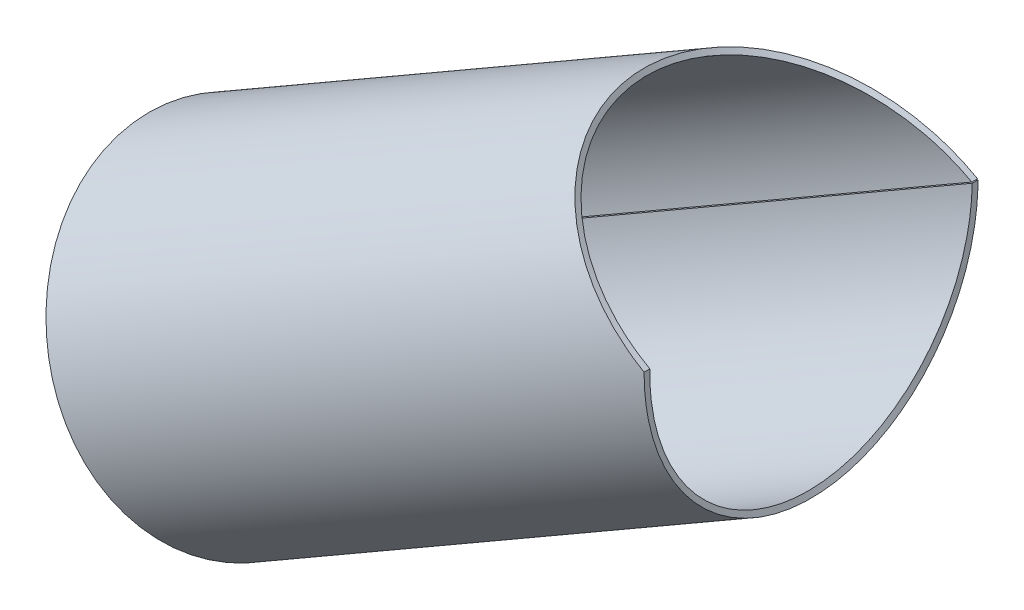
ISO-10303-21;
HEADER;
FILE_DESCRIPTION(('STEP AP214'),'2;1');
FILE_NAME('part.step','',(''),(''),'','','');
FILE_SCHEMA(('AUTOMOTIVE_DESIGN { 1 0 10303 214 1 1 1 1 }'));
ENDSEC;
DATA;
#1=APPLICATION_CONTEXT('core data for automotive mechanical design processes');
#2=APPLICATION_PROTOCOL_DEFINITION('international standard','automotive_design',2000,#1);
#3=PRODUCT_CONTEXT('',#1,'mechanical');
#4=PRODUCT('Part','Part','',(#3));
#5=PRODUCT_RELATED_PRODUCT_CATEGORY('part','',(#4));
#6=PRODUCT_DEFINITION_FORMATION('','',#4);
#7=PRODUCT_DEFINITION_CONTEXT('part definition',#1,'design');
#8=PRODUCT_DEFINITION('design','',#6,#7);
#9=PRODUCT_DEFINITION_SHAPE('','',#8);
#10=(LENGTH_UNIT() NAMED_UNIT(*) SI_UNIT(.MILLI.,.METRE.));
#11=(NAMED_UNIT(*) PLANE_ANGLE_UNIT() SI_UNIT($,.RADIAN.));
#12=(NAMED_UNIT(*) SI_UNIT($,.STERADIAN.) SOLID_ANGLE_UNIT());
#13=UNCERTAINTY_MEASURE_WITH_UNIT(LENGTH_MEASURE(1.E-05),#10,'distance_accuracy_value','');
#14=(GEOMETRIC_REPRESENTATION_CONTEXT(3) GLOBAL_UNCERTAINTY_ASSIGNED_CONTEXT((#13)) GLOBAL_UNIT_ASSIGNED_CONTEXT((#10,
#11,#12)) REPRESENTATION_CONTEXT('',''));
#15=CARTESIAN_POINT('',(0.,0.,0.));
#16=DIRECTION('',(0.,0.,1.));
#17=DIRECTION('',(1.,0.,0.));
#18=AXIS2_PLACEMENT_3D('',#15,#16,#17);
#19=CARTESIAN_POINT('',(6.96073041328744E-13,-0.577350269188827,-174.999285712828));
#20=CARTESIAN_POINT('',(3.5034844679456E-06,-6.2323068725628,-174.985293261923));
#21=CARTESIAN_POINT('',(0.000700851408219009,-10.9379518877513,-174.773839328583));
#22=CARTESIAN_POINT('',(0.000268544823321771,-15.6318231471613,-174.477492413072));
#23=CARTESIAN_POINT('',(0.000164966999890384,-16.5112345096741,-174.416284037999));
#24=CARTESIAN_POINT('',(5.43477490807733E-05,-17.7414291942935,-174.324575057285));
#25=CARTESIAN_POINT('',(2.51888428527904E-05,-18.1366741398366,-174.294018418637));
#26=CARTESIAN_POINT('',(-3.5989789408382E-06,-18.8975485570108,-174.233382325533));
#27=CARTESIAN_POINT('',(4.23903022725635E-07,-19.2610943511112,-174.203498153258));
#28=CARTESIAN_POINT('',(1.49064017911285E-05,-21.0880958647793,-174.04909183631));
#29=CARTESIAN_POINT('',(6.42685422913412E-05,-22.5168968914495,-173.914412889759));
#30=CARTESIAN_POINT('',(0.000184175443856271,-26.7046543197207,-173.482191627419));
#31=CARTESIAN_POINT('',(0.00020019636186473,-29.3649194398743,-173.156544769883));
#32=CARTESIAN_POINT('',(0.000100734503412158,-33.1579095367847,-172.631519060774));
#33=CARTESIAN_POINT('',(5.39689495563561E-05,-34.3893503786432,-172.450398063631));
#34=CARTESIAN_POINT('',(2.18266209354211E-06,-36.7865731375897,-172.078972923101));
#35=CARTESIAN_POINT('',(1.40985934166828E-05,-37.9482135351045,-171.889448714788));
#36=CARTESIAN_POINT('',(0.000116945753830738,-43.7058791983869,-170.906039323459));
#37=CARTESIAN_POINT('',(0.000150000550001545,-48.0734920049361,-170.01587712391));
#38=CARTESIAN_POINT('',(8.6438265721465E-06,-54.2669287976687,-168.581582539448));
#39=CARTESIAN_POINT('',(2.94419470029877E-06,-56.2657998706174,-168.088621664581));
#40=CARTESIAN_POINT('',(5.24208270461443E-05,-60.2000348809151,-167.063249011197));
#41=CARTESIAN_POINT('',(8.30701434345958E-05,-62.1301708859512,-166.531872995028));
#42=CARTESIAN_POINT('',(9.02001709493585E-05,-65.916365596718,-165.436565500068));
#43=CARTESIAN_POINT('',(6.70368000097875E-05,-67.7724249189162,-164.87263424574));
#44=CARTESIAN_POINT('',(1.38582110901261E-05,-71.4105482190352,-163.716874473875));
#45=CARTESIAN_POINT('',(-3.10995541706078E-07,-73.1894314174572,-163.126176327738));
#46=CARTESIAN_POINT('',(4.52989549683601E-05,-78.4451884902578,-161.308516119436));
#47=CARTESIAN_POINT('',(8.53857500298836E-05,-81.8396794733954,-160.036038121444));
#48=CARTESIAN_POINT('',(1.76238337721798E-05,-88.4096775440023,-157.393248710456));
#49=CARTESIAN_POINT('',(7.26874488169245E-06,-91.5795435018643,-156.025758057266));
#50=CARTESIAN_POINT('',(6.62335065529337E-05,-97.7503354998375,-153.192022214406));
#51=CARTESIAN_POINT('',(5.5619235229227E-05,-100.746834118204,-151.727243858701));
#52=CARTESIAN_POINT('',(-6.10709081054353E-06,-106.562105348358,-148.717832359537));
#53=CARTESIAN_POINT('',(3.01106656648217E-05,-109.379622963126,-147.17427377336));
#54=CARTESIAN_POINT('',(0.000377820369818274,-114.87970388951,-143.997044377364));
#55=CARTESIAN_POINT('',(0.000582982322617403,-117.556885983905,-142.366052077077));
#56=CARTESIAN_POINT('',(0.000823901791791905,-125.369045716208,-137.362058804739));
#57=CARTESIAN_POINT('',(0.000320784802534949,-130.284352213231,-133.878243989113));
#58=CARTESIAN_POINT('',(-0.000105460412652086,-137.220405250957,-128.491887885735));
#59=CARTESIAN_POINT('',(-5.94633741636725E-05,-139.458446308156,-126.67088328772));
#60=CARTESIAN_POINT('',(0.000174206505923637,-143.816006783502,-122.962167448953));
#61=CARTESIAN_POINT('',(0.00032998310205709,-145.932223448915,-121.076912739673));
#62=CARTESIAN_POINT('',(0.000587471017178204,-152.092616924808,-115.338991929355));
#63=CARTESIAN_POINT('',(0.000385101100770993,-155.948373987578,-111.404269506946));
#64=CARTESIAN_POINT('',(-0.000117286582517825,-163.158670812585,-103.369905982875));
#65=CARTESIAN_POINT('',(4.39148766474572E-05,-166.510825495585,-99.2745341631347));
#66=CARTESIAN_POINT('',(0.000471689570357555,-172.763700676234,-90.9081291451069));
#67=CARTESIAN_POINT('',(0.000520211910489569,-175.65827894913,-86.6433877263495));
#68=CARTESIAN_POINT('',(0.000167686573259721,-180.983511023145,-77.9918538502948));
#69=CARTESIAN_POINT('',(-0.000123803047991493,-183.412092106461,-73.6092427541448));
#70=CARTESIAN_POINT('',(0.00021312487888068,-187.818154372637,-64.7419385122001));
#71=CARTESIAN_POINT('',(0.000506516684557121,-189.799222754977,-60.2493752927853));
#72=CARTESIAN_POINT('',(0.000545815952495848,-193.316052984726,-51.1807147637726));
#73=CARTESIAN_POINT('',(0.000294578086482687,-194.851819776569,-46.6046255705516));
#74=CARTESIAN_POINT('',(-6.42263830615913E-05,-197.479243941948,-37.4023626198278));
#75=CARTESIAN_POINT('',(0.000101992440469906,-198.571013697,-32.7776382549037));
#76=CARTESIAN_POINT('',(0.000657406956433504,-201.195355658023,-18.8179163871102));
#77=CARTESIAN_POINT('',(1.94450607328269E-06,-202.069984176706,-9.41624540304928));
#78=CARTESIAN_POINT('',(-2.0237386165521E-06,-202.075192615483,9.33207628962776));
#79=CARTESIAN_POINT('',(0.000681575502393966,-201.204701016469,18.746256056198));
#80=CARTESIAN_POINT('',(0.000128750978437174,-198.584389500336,32.7172425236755));
#81=CARTESIAN_POINT('',(-7.32217867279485E-05,-197.493625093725,37.3457538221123));
#82=CARTESIAN_POINT('',(0.000267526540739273,-194.867968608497,46.554298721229));
#83=CARTESIAN_POINT('',(0.000537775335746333,-193.33272576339,51.1337901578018));
#84=CARTESIAN_POINT('',(0.000531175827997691,-189.81611729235,60.2096800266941));
#85=CARTESIAN_POINT('',(0.000251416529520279,-187.834746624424,64.706070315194));
#86=CARTESIAN_POINT('',(-0.000118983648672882,-183.427157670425,73.5813341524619));
#87=CARTESIAN_POINT('',(0.000131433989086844,-180.998459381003,77.9660632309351));
#88=CARTESIAN_POINT('',(0.000502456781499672,-175.671325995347,86.6237370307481));
#89=CARTESIAN_POINT('',(0.000481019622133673,-172.775300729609,90.8917976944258));
#90=CARTESIAN_POINT('',(6.88491369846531E-05,-166.518410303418,99.2651681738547));
#91=CARTESIAN_POINT('',(-0.00013745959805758,-163.164058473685,103.363682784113));
#92=CARTESIAN_POINT('',(0.000365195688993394,-155.949957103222,111.402750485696));
#93=CARTESIAN_POINT('',(0.000606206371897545,-152.091549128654,115.340230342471));
#94=CARTESIAN_POINT('',(0.000372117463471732,-145.925896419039,121.082655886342));
#95=CARTESIAN_POINT('',(0.000218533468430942,-143.80771313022,122.969473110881));
#96=CARTESIAN_POINT('',(-3.52135826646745E-05,-139.445769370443,126.681390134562));
#97=CARTESIAN_POINT('',(-0.00011803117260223,-137.205522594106,128.50384195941));
#98=CARTESIAN_POINT('',(0.000252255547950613,-130.26522540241,133.892343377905));
#99=CARTESIAN_POINT('',(0.000803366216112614,-125.345691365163,137.378275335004));
#100=CARTESIAN_POINT('',(0.000606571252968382,-117.52482328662,142.385950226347));
#101=CARTESIAN_POINT('',(0.000411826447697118,-114.84434451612,144.018252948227));
#102=CARTESIAN_POINT('',(5.55090815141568E-05,-109.336846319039,147.198169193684));
#103=CARTESIAN_POINT('',(-1.01315796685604E-05,-106.515387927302,148.742980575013));
#104=CARTESIAN_POINT('',(4.97960497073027E-05,-100.69425388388,151.753468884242));
#105=CARTESIAN_POINT('',(6.94213577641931E-05,-97.6941789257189,153.218957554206));
#106=CARTESIAN_POINT('',(1.37648517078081E-05,-91.5148845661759,156.05427777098));
#107=CARTESIAN_POINT('',(9.70412130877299E-06,-88.3412632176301,157.422123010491));
#108=CARTESIAN_POINT('',(8.36076227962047E-05,-81.7633002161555,160.065379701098));
#109=CARTESIAN_POINT('',(5.422185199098E-05,-78.3637584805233,161.338300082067));
#110=CARTESIAN_POINT('',(2.0260025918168E-06,-73.0987638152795,163.156689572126));
#111=CARTESIAN_POINT('',(7.95036950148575E-06,-71.3178284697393,163.747197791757));
#112=CARTESIAN_POINT('',(4.82812278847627E-05,-67.6763835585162,164.902235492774));
#113=CARTESIAN_POINT('',(6.5929207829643E-05,-65.8186709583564,165.465752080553));
#114=CARTESIAN_POINT('',(5.20918337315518E-05,-62.0291890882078,166.560121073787));
#115=CARTESIAN_POINT('',(2.02506867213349E-05,-60.0974192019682,167.090973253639));
#116=CARTESIAN_POINT('',(-2.45844495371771E-05,-56.1599405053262,168.115187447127));
#117=CARTESIAN_POINT('',(-1.41434380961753E-05,-54.1611642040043,168.607078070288));
#118=CARTESIAN_POINT('',(0.000147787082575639,-47.9714935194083,170.037423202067));
#119=CARTESIAN_POINT('',(0.000137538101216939,-43.6039268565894,170.925609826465));
#120=CARTESIAN_POINT('',(2.12957858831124E-05,-37.8431458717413,171.906822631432));
#121=CARTESIAN_POINT('',(-1.67944016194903E-07,-36.6822046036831,172.095664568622));
#122=CARTESIAN_POINT('',(3.93318325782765E-05,-34.29136169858,172.465015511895));
#123=CARTESIAN_POINT('',(8.68724830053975E-05,-33.0620732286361,172.64529864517));
#124=CARTESIAN_POINT('',(0.000196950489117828,-29.2724059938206,173.168265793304));
#125=CARTESIAN_POINT('',(0.000198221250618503,-26.6101756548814,173.493152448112));
#126=CARTESIAN_POINT('',(8.07420805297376E-05,-22.4131324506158,173.924482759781));
#127=CARTESIAN_POINT('',(2.84543718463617E-05,-20.9801801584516,174.058904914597));
#128=CARTESIAN_POINT('',(-1.55327779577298E-06,-18.7799628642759,174.243771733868));
#129=CARTESIAN_POINT('',(-9.73146884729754E-06,-18.0524778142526,174.301684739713));
#130=CARTESIAN_POINT('',(0.000121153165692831,-16.4316939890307,174.421885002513));
#131=CARTESIAN_POINT('',(0.000232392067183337,-15.5535892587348,174.482766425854));
#132=CARTESIAN_POINT('',(0.000728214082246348,-10.8240003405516,174.779621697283));
#133=CARTESIAN_POINT('',(1.64514319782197E-06,-5.95442470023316,175.));
#134=CARTESIAN_POINT('',(9.94286403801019E-13,-1.43749182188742E-13,175.));
#135=CARTESIAN_POINT('',(-0.0085714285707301,-0.56250411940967,-168.999310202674));
#136=CARTESIAN_POINT('',(-0.092522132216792,-6.07203728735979,-168.985797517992));
#137=CARTESIAN_POINT('',(-0.161691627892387,-10.6566798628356,-168.781593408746));
#138=CARTESIAN_POINT('',(-0.231806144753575,-15.2298579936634,-168.49540695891));
#139=CARTESIAN_POINT('',(-0.244964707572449,-16.086657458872,-168.436297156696));
#140=CARTESIAN_POINT('',(-0.26333803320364,-17.2852202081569,-168.347732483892));
#141=CARTESIAN_POINT('',(-0.269234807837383,-17.6703021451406,-168.318223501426));
#142=CARTESIAN_POINT('',(-0.280559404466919,-18.4116116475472,-168.259666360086));
#143=CARTESIAN_POINT('',(-0.285952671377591,-18.7658090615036,-168.230806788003));
#144=CARTESIAN_POINT('',(-0.313062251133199,-20.5458303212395,-168.081694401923));
#145=CARTESIAN_POINT('',(-0.334225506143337,-21.9378900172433,-167.951633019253));
#146=CARTESIAN_POINT('',(-0.396278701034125,-26.0179604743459,-167.534230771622));
#147=CARTESIAN_POINT('',(-0.435757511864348,-28.6098185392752,-167.219748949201));
#148=CARTESIAN_POINT('',(-0.492167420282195,-32.3052760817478,-166.712724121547));
#149=CARTESIAN_POINT('',(-0.510495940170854,-33.505051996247,-166.537812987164));
#150=CARTESIAN_POINT('',(-0.546136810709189,-35.8406326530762,-166.179122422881));
#151=CARTESIAN_POINT('',(-0.563370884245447,-36.9724021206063,-165.996096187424));
#152=CARTESIAN_POINT('',(-0.64874808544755,-42.5820119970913,-165.046403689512));
#153=CARTESIAN_POINT('',(-0.713557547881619,-46.8373142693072,-164.186761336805));
#154=CARTESIAN_POINT('',(-0.80564638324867,-52.8714933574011,-162.801642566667));
#155=CARTESIAN_POINT('',(-0.835327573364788,-54.8189649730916,-162.32558320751));
#156=CARTESIAN_POINT('',(-0.893686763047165,-58.6520332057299,-161.335366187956));
#157=CARTESIAN_POINT('',(-0.92231146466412,-60.5325366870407,-160.822208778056));
#158=CARTESIAN_POINT('',(-0.978514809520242,-64.2213719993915,-159.764454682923));
#159=CARTESIAN_POINT('',(-1.00609310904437,-66.0297044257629,-159.219858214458));
#160=CARTESIAN_POINT('',(-1.06015795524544,-69.5742767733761,-158.103724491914));
#161=CARTESIAN_POINT('',(-1.08658156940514,-71.3074174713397,-157.533278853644));
#162=CARTESIAN_POINT('',(-1.16456410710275,-76.4280258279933,-155.777938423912));
#163=CARTESIAN_POINT('',(-1.21491948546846,-79.7352293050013,-154.549088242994));
#164=CARTESIAN_POINT('',(-1.31252584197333,-86.1362855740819,-151.996908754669));
#165=CARTESIAN_POINT('',(-1.3595964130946,-89.2246408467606,-150.676303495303));
#166=CARTESIAN_POINT('',(-1.45115045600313,-95.2367544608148,-147.939724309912));
#167=CARTESIAN_POINT('',(-1.49564744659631,-98.1562004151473,-146.525166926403));
#168=CARTESIAN_POINT('',(-1.58204303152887,-103.821937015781,-143.618935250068));
#169=CARTESIAN_POINT('',(-1.62383641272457,-106.567003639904,-142.128298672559));
#170=CARTESIAN_POINT('',(-1.70514670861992,-111.925648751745,-139.060002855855));
#171=CARTESIAN_POINT('',(-1.74468915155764,-114.53398597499,-137.484930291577));
#172=CARTESIAN_POINT('',(-1.86043079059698,-122.145258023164,-132.652502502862));
#173=CARTESIAN_POINT('',(-1.9339029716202,-126.934178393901,-129.288132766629));
#174=CARTESIAN_POINT('',(-2.03729924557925,-133.691882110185,-124.086451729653));
#175=CARTESIAN_POINT('',(-2.07047993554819,-135.87237285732,-122.327881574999));
#176=CARTESIAN_POINT('',(-2.13494126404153,-140.117878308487,-118.746321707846));
#177=CARTESIAN_POINT('',(-2.16620449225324,-142.17967566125,-116.925704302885));
#178=CARTESIAN_POINT('',(-2.25740733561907,-148.181655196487,-111.384512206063));
#179=CARTESIAN_POINT('',(-2.31485111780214,-151.938267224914,-107.584694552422));
#180=CARTESIAN_POINT('',(-2.42239434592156,-158.963163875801,-99.8257949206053));
#181=CARTESIAN_POINT('',(-2.47200111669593,-162.229117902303,-95.8708358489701));
#182=CARTESIAN_POINT('',(-2.56440813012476,-168.321198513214,-87.791279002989));
#183=CARTESIAN_POINT('',(-2.60733336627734,-171.141344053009,-83.6727572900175));
#184=CARTESIAN_POINT('',(-2.68674206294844,-176.329646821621,-75.3178474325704));
#185=CARTESIAN_POINT('',(-2.72308613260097,-178.69578300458,-71.0854972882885));
#186=CARTESIAN_POINT('',(-2.78816515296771,-182.988541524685,-62.5222149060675));
#187=CARTESIAN_POINT('',(-2.81728551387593,-184.918663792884,-58.1836824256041));
#188=CARTESIAN_POINT('',(-2.86945793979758,-188.345060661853,-49.4259474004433));
#189=CARTESIAN_POINT('',(-2.89250724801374,-189.841340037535,-45.006752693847));
#190=CARTESIAN_POINT('',(-2.93187010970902,-192.401207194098,-36.1199959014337));
#191=CARTESIAN_POINT('',(-2.94791389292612,-193.464900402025,-31.6538335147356));
#192=CARTESIAN_POINT('',(-2.9863246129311,-196.021751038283,-18.1727306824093));
#193=CARTESIAN_POINT('',(-2.99995932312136,-196.873898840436,-9.09340270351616));
#194=CARTESIAN_POINT('',(-3.00004058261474,-196.878973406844,9.0121193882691));
#195=CARTESIAN_POINT('',(-2.98643939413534,-196.030855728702,18.1035272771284));
#196=CARTESIAN_POINT('',(-2.94808594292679,-193.477931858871,31.5955084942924));
#197=CARTESIAN_POINT('',(-2.93209253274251,-192.415218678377,36.0653279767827));
#198=CARTESIAN_POINT('',(-2.89277381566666,-189.857074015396,44.9581513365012));
#199=CARTESIAN_POINT('',(-2.86971343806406,-188.361304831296,49.3806316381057));
#200=CARTESIAN_POINT('',(-2.81751188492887,-184.935123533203,58.1453481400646));
#201=CARTESIAN_POINT('',(-2.78837352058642,-183.004706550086,62.4875764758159));
#202=CARTESIAN_POINT('',(-2.7233050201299,-178.710461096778,71.0585455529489));
#203=CARTESIAN_POINT('',(-2.68699993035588,-176.344211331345,75.2929410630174));
#204=CARTESIAN_POINT('',(-2.60754466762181,-171.154055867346,83.653780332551));
#205=CARTESIAN_POINT('',(-2.56457109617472,-168.332500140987,87.7755074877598));
#206=CARTESIAN_POINT('',(-2.47208900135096,-162.236507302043,95.8617909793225));
#207=CARTESIAN_POINT('',(-2.42249433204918,-158.968413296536,99.8197850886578));
#208=CARTESIAN_POINT('',(-2.31489435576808,-151.93980992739,107.5832276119));
#209=CARTESIAN_POINT('',(-2.25737290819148,-148.180614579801,111.3857081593));
#210=CARTESIAN_POINT('',(-2.16606878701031,-142.173510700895,116.931250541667));
#211=CARTESIAN_POINT('',(-2.13477418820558,-140.109797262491,118.753376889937));
#212=CARTESIAN_POINT('',(-2.07026768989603,-135.860021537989,122.338028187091));
#213=CARTESIAN_POINT('',(-2.03709075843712,-133.677382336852,124.097995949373));
#214=CARTESIAN_POINT('',(-1.93368695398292,-126.915544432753,129.301748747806));
#215=CARTESIAN_POINT('',(-1.86010442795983,-122.122504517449,132.668163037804));
#216=CARTESIAN_POINT('',(-1.7441897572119,-114.502747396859,137.504146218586));
#217=CARTESIAN_POINT('',(-1.70458804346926,-111.891198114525,139.080484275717));
#218=CARTESIAN_POINT('',(-1.62317616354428,-106.525326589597,142.151374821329));
#219=CARTESIAN_POINT('',(-1.58135344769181,-103.776420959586,143.643221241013));
#220=CARTESIAN_POINT('',(-1.49487260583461,-98.1049723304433,146.550492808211));
#221=CARTESIAN_POINT('',(-1.45031358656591,-95.1820418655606,147.965736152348));
#222=CARTESIAN_POINT('',(-1.3586300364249,-89.1616444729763,150.703845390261));
#223=CARTESIAN_POINT('',(-1.31151800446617,-86.0696305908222,152.024793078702));
#224=CARTESIAN_POINT('',(-1.21378731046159,-79.6608141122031,154.577423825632));
#225=CARTESIAN_POINT('',(-1.16334633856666,-76.3486896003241,155.80670122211));
#226=CARTESIAN_POINT('',(-1.08523318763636,-71.2190812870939,157.562745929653));
#227=CARTESIAN_POINT('',(-1.05878728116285,-69.4839413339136,158.133008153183));
#228=CARTESIAN_POINT('',(-1.00468585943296,-65.9361329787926,159.248444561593));
#229=CARTESIAN_POINT('',(-0.977088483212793,-64.1261898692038,159.792640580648));
#230=CARTESIAN_POINT('',(-0.920842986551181,-60.434152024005,160.849488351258));
#231=CARTESIAN_POINT('',(-0.892195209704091,-58.5520566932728,161.362139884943));
#232=CARTESIAN_POINT('',(-0.833783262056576,-54.7158281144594,162.351238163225));
#233=CARTESIAN_POINT('',(-0.804098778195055,-52.7684487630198,162.826263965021));
#234=CARTESIAN_POINT('',(-0.712045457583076,-46.7379386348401,164.207568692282));
#235=CARTESIAN_POINT('',(-0.647214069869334,-42.482680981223,165.065303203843));
#236=CARTESIAN_POINT('',(-0.561803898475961,-36.8700360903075,166.012874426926));
#237=CARTESIAN_POINT('',(-0.544589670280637,-35.7389479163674,166.195241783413));
#238=CARTESIAN_POINT('',(-0.50905569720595,-33.4095832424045,166.551929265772));
#239=CARTESIAN_POINT('',(-0.490758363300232,-32.2119043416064,166.72603126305));
#240=CARTESIAN_POINT('',(-0.434387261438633,-28.5196840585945,167.231068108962));
#241=CARTESIAN_POINT('',(-0.394862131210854,-25.925911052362,167.544815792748));
#242=CARTESIAN_POINT('',(-0.332668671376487,-21.8367935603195,167.961357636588));
#243=CARTESIAN_POINT('',(-0.311446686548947,-20.4406893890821,168.091171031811));
#244=CARTESIAN_POINT('',(-0.278811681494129,-18.2970495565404,168.269699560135));
#245=CARTESIAN_POINT('',(-0.268019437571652,-17.588271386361,168.325626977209));
#246=CARTESIAN_POINT('',(-0.24382727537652,-16.009162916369,168.441706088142));
#247=CARTESIAN_POINT('',(-0.230680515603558,-15.1536363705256,168.500500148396));
#248=CARTESIAN_POINT('',(-0.159972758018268,-10.5456580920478,168.787177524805));
#249=CARTESIAN_POINT('',(-0.0883984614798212,-5.80129853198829,169.));
#250=CARTESIAN_POINT('',(9.86403163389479E-13,-1.24041081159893E-13,169.));
#251=B_SPLINE_SURFACE_WITH_KNOTS('',1,3,((#19,#20,#21,#22,#23,#24,#25,#26,#27,#28,#29,#30,#31,
#32,#33,#34,#35,#36,#37,#38,#39,#40,#41,#42,#43,#44,#45,#46,#47,#48,#49,#50,#51,#52,#53,#54,#55,
#56,#57,#58,#59,#60,#61,#62,#63,#64,#65,#66,#67,#68,#69,#70,#71,#72,#73,#74,#75,#76,#77,#78,#79,
#80,#81,#82,#83,#84,#85,#86,#87,#88,#89,#90,#91,#92,#93,#94,#95,#96,#97,#98,#99,#100,#101,#102,
#103,#104,#105,#106,#107,#108,#109,#110,#111,#112,#113,#114,#115,#116,#117,#118,#119,#120,#121,
#122,#123,#124,#125,#126,#127,#128,#129,#130,#131,#132,#133,#134),(#135,#136,#137,#138,#139,
#140,#141,#142,#143,#144,#145,#146,#147,#148,#149,#150,#151,#152,#153,#154,#155,#156,#157,#158,
#159,#160,#161,#162,#163,#164,#165,#166,#167,#168,#169,#170,#171,#172,#173,#174,#175,#176,#177,
#178,#179,#180,#181,#182,#183,#184,#185,#186,#187,#188,#189,#190,#191,#192,#193,#194,#195,#196,
#197,#198,#199,#200,#201,#202,#203,#204,#205,#206,#207,#208,#209,#210,#211,#212,#213,#214,#215,
#216,#217,#218,#219,#220,#221,#222,#223,#224,#225,#226,#227,#228,#229,#230,#231,#232,#233,#234,
#235,#236,#237,#238,#239,#240,#241,#242,#243,#244,#245,#246,#247,#248,#249,#250)),.UNSPECIFIED.,
.F.,.F.,.F.,(2,2),(4,2,2,2,2,2,2,2,2,2,2,2,2,2,2,2,2,2,2,2,2,2,2,2,2,2,2,2,2,2,2,2,2,2,2,2,2,2,
2,2,2,2,2,2,2,2,2,2,2,2,2,2,2,2,2,2,2,4),(0.,1.),(0.,0.0078125,0.009765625,0.0107421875,
0.01171875,0.015625,0.0234375,0.02734375,0.03125,0.046875,0.0546875,0.0625,0.0703125,0.078125,
0.09375,0.109375,0.125,0.140625,0.15625,0.1875,0.203125,0.21875,0.25,0.28125,0.3125,0.34375,
0.375,0.40625,0.4375,0.5,0.5625,0.59375,0.625,0.65625,0.6875,0.71875,0.75,0.78125,0.796875,
0.8125,0.84375,0.859375,0.875,0.890625,0.90625,0.921875,0.9296875,0.9375,0.9453125,0.953125,
0.96875,0.97265625,0.9765625,0.984375,0.98828125,0.990234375,0.9921875,1.),.UNSPECIFIED.);
#252=CARTESIAN_POINT('',(6.96073041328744E-13,-0.577350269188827,-174.999285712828));
#253=CARTESIAN_POINT('',(-0.0085714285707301,-0.56250411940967,-168.999310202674));
#254=B_SPLINE_CURVE_WITH_KNOTS('',1,(#252,#253),.UNSPECIFIED.,.F.,.F.,(2,2),(0.,1.),.UNSPECIFIED.);
#255=CARTESIAN_POINT('',(-0.00857142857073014,-0.56250411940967,-168.999310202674));
#256=VERTEX_POINT('',#255);
#257=CARTESIAN_POINT('',(6.94702542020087E-13,-0.577350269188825,-174.999285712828));
#258=VERTEX_POINT('',#257);
#259=EDGE_CURVE('E13',#256,#258,#254,.F.);
#260=CARTESIAN_POINT('',(-0.0085714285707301,-0.56250411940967,-168.999310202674));
#261=CARTESIAN_POINT('',(-0.092522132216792,-6.07203728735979,-168.985797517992));
#262=CARTESIAN_POINT('',(-0.161691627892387,-10.6566798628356,-168.781593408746));
#263=CARTESIAN_POINT('',(-0.231806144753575,-15.2298579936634,-168.49540695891));
#264=CARTESIAN_POINT('',(-0.244964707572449,-16.086657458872,-168.436297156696));
#265=CARTESIAN_POINT('',(-0.26333803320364,-17.2852202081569,-168.347732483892));
#266=CARTESIAN_POINT('',(-0.269234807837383,-17.6703021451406,-168.318223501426));
#267=CARTESIAN_POINT('',(-0.280559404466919,-18.4116116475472,-168.259666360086));
#268=CARTESIAN_POINT('',(-0.285952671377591,-18.7658090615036,-168.230806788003));
#269=CARTESIAN_POINT('',(-0.313062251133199,-20.5458303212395,-168.081694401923));
#270=CARTESIAN_POINT('',(-0.334225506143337,-21.9378900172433,-167.951633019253));
#271=CARTESIAN_POINT('',(-0.396278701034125,-26.0179604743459,-167.534230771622));
#272=CARTESIAN_POINT('',(-0.435757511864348,-28.6098185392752,-167.219748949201));
#273=CARTESIAN_POINT('',(-0.492167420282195,-32.3052760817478,-166.712724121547));
#274=CARTESIAN_POINT('',(-0.510495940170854,-33.505051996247,-166.537812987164));
#275=CARTESIAN_POINT('',(-0.546136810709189,-35.8406326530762,-166.179122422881));
#276=CARTESIAN_POINT('',(-0.563370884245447,-36.9724021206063,-165.996096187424));
#277=CARTESIAN_POINT('',(-0.64874808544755,-42.5820119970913,-165.046403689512));
#278=CARTESIAN_POINT('',(-0.713557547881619,-46.8373142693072,-164.186761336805));
#279=CARTESIAN_POINT('',(-0.80564638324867,-52.8714933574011,-162.801642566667));
#280=CARTESIAN_POINT('',(-0.835327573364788,-54.8189649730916,-162.32558320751));
#281=CARTESIAN_POINT('',(-0.893686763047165,-58.6520332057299,-161.335366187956));
#282=CARTESIAN_POINT('',(-0.92231146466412,-60.5325366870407,-160.822208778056));
#283=CARTESIAN_POINT('',(-0.978514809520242,-64.2213719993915,-159.764454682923));
#284=CARTESIAN_POINT('',(-1.00609310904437,-66.0297044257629,-159.219858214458));
#285=CARTESIAN_POINT('',(-1.06015795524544,-69.5742767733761,-158.103724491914));
#286=CARTESIAN_POINT('',(-1.08658156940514,-71.3074174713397,-157.533278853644));
#287=CARTESIAN_POINT('',(-1.16456410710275,-76.4280258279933,-155.777938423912));
#288=CARTESIAN_POINT('',(-1.21491948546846,-79.7352293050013,-154.549088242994));
#289=CARTESIAN_POINT('',(-1.31252584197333,-86.1362855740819,-151.996908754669));
#290=CARTESIAN_POINT('',(-1.3595964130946,-89.2246408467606,-150.676303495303));
#291=CARTESIAN_POINT('',(-1.45115045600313,-95.2367544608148,-147.939724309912));
#292=CARTESIAN_POINT('',(-1.49564744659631,-98.1562004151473,-146.525166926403));
#293=CARTESIAN_POINT('',(-1.58204303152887,-103.821937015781,-143.618935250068));
#294=CARTESIAN_POINT('',(-1.62383641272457,-106.567003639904,-142.128298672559));
#295=CARTESIAN_POINT('',(-1.70514670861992,-111.925648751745,-139.060002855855));
#296=CARTESIAN_POINT('',(-1.74468915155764,-114.53398597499,-137.484930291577));
#297=CARTESIAN_POINT('',(-1.86043079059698,-122.145258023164,-132.652502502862));
#298=CARTESIAN_POINT('',(-1.9339029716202,-126.934178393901,-129.288132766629));
#299=CARTESIAN_POINT('',(-2.03729924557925,-133.691882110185,-124.086451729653));
#300=CARTESIAN_POINT('',(-2.07047993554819,-135.87237285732,-122.327881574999));
#301=CARTESIAN_POINT('',(-2.13494126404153,-140.117878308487,-118.746321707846));
#302=CARTESIAN_POINT('',(-2.16620449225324,-142.17967566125,-116.925704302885));
#303=CARTESIAN_POINT('',(-2.25740733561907,-148.181655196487,-111.384512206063));
#304=CARTESIAN_POINT('',(-2.31485111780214,-151.938267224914,-107.584694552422));
#305=CARTESIAN_POINT('',(-2.42239434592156,-158.963163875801,-99.8257949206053));
#306=CARTESIAN_POINT('',(-2.47200111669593,-162.229117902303,-95.8708358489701));
#307=CARTESIAN_POINT('',(-2.56440813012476,-168.321198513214,-87.791279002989));
#308=CARTESIAN_POINT('',(-2.60733336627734,-171.141344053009,-83.6727572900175));
#309=CARTESIAN_POINT('',(-2.68674206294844,-176.329646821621,-75.3178474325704));
#310=CARTESIAN_POINT('',(-2.72308613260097,-178.69578300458,-71.0854972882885));
#311=CARTESIAN_POINT('',(-2.78816515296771,-182.988541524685,-62.5222149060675));
#312=CARTESIAN_POINT('',(-2.81728551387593,-184.918663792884,-58.1836824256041));
#313=CARTESIAN_POINT('',(-2.86945793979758,-188.345060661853,-49.4259474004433));
#314=CARTESIAN_POINT('',(-2.89250724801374,-189.841340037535,-45.006752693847));
#315=CARTESIAN_POINT('',(-2.93187010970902,-192.401207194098,-36.1199959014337));
#316=CARTESIAN_POINT('',(-2.94791389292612,-193.464900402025,-31.6538335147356));
#317=CARTESIAN_POINT('',(-2.9863246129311,-196.021751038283,-18.1727306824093));
#318=CARTESIAN_POINT('',(-2.99995932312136,-196.873898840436,-9.09340270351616));
#319=CARTESIAN_POINT('',(-3.00004058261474,-196.878973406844,9.0121193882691));
#320=CARTESIAN_POINT('',(-2.98643939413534,-196.030855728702,18.1035272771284));
#321=CARTESIAN_POINT('',(-2.94808594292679,-193.477931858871,31.5955084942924));
#322=CARTESIAN_POINT('',(-2.93209253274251,-192.415218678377,36.0653279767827));
#323=CARTESIAN_POINT('',(-2.89277381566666,-189.857074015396,44.9581513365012));
#324=CARTESIAN_POINT('',(-2.86971343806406,-188.361304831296,49.3806316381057));
#325=CARTESIAN_POINT('',(-2.81751188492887,-184.935123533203,58.1453481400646));
#326=CARTESIAN_POINT('',(-2.78837352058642,-183.004706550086,62.4875764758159));
#327=CARTESIAN_POINT('',(-2.7233050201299,-178.710461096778,71.0585455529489));
#328=CARTESIAN_POINT('',(-2.68699993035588,-176.344211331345,75.2929410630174));
#329=CARTESIAN_POINT('',(-2.60754466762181,-171.154055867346,83.653780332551));
#330=CARTESIAN_POINT('',(-2.56457109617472,-168.332500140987,87.7755074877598));
#331=CARTESIAN_POINT('',(-2.47208900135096,-162.236507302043,95.8617909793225));
#332=CARTESIAN_POINT('',(-2.42249433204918,-158.968413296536,99.8197850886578));
#333=CARTESIAN_POINT('',(-2.31489435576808,-151.93980992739,107.5832276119));
#334=CARTESIAN_POINT('',(-2.25737290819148,-148.180614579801,111.3857081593));
#335=CARTESIAN_POINT('',(-2.16606878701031,-142.173510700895,116.931250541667));
#336=CARTESIAN_POINT('',(-2.13477418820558,-140.109797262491,118.753376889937));
#337=CARTESIAN_POINT('',(-2.07026768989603,-135.860021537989,122.338028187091));
#338=CARTESIAN_POINT('',(-2.03709075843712,-133.677382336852,124.097995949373));
#339=CARTESIAN_POINT('',(-1.93368695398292,-126.915544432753,129.301748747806));
#340=CARTESIAN_POINT('',(-1.86010442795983,-122.122504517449,132.668163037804));
#341=CARTESIAN_POINT('',(-1.7441897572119,-114.502747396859,137.504146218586));
#342=CARTESIAN_POINT('',(-1.70458804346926,-111.891198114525,139.080484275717));
#343=CARTESIAN_POINT('',(-1.62317616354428,-106.525326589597,142.151374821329));
#344=CARTESIAN_POINT('',(-1.58135344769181,-103.776420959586,143.643221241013));
#345=CARTESIAN_POINT('',(-1.49487260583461,-98.1049723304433,146.550492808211));
#346=CARTESIAN_POINT('',(-1.45031358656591,-95.1820418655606,147.965736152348));
#347=CARTESIAN_POINT('',(-1.3586300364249,-89.1616444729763,150.703845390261));
#348=CARTESIAN_POINT('',(-1.31151800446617,-86.0696305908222,152.024793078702));
#349=CARTESIAN_POINT('',(-1.21378731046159,-79.6608141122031,154.577423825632));
#350=CARTESIAN_POINT('',(-1.16334633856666,-76.3486896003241,155.80670122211));
#351=CARTESIAN_POINT('',(-1.08523318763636,-71.2190812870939,157.562745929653));
#352=CARTESIAN_POINT('',(-1.05878728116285,-69.4839413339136,158.133008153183));
#353=CARTESIAN_POINT('',(-1.00468585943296,-65.9361329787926,159.248444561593));
#354=CARTESIAN_POINT('',(-0.977088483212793,-64.1261898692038,159.792640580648));
#355=CARTESIAN_POINT('',(-0.920842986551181,-60.434152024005,160.849488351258));
#356=CARTESIAN_POINT('',(-0.892195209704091,-58.5520566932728,161.362139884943));
#357=CARTESIAN_POINT('',(-0.833783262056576,-54.7158281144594,162.351238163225));
#358=CARTESIAN_POINT('',(-0.804098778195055,-52.7684487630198,162.826263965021));
#359=CARTESIAN_POINT('',(-0.712045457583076,-46.7379386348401,164.207568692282));
#360=CARTESIAN_POINT('',(-0.647214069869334,-42.482680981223,165.065303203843));
#361=CARTESIAN_POINT('',(-0.561803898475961,-36.8700360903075,166.012874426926));
#362=CARTESIAN_POINT('',(-0.544589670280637,-35.7389479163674,166.195241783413));
#363=CARTESIAN_POINT('',(-0.50905569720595,-33.4095832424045,166.551929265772));
#364=CARTESIAN_POINT('',(-0.490758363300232,-32.2119043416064,166.72603126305));
#365=CARTESIAN_POINT('',(-0.434387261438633,-28.5196840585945,167.231068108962));
#366=CARTESIAN_POINT('',(-0.394862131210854,-25.925911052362,167.544815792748));
#367=CARTESIAN_POINT('',(-0.332668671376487,-21.8367935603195,167.961357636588));
#368=CARTESIAN_POINT('',(-0.311446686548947,-20.4406893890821,168.091171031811));
#369=CARTESIAN_POINT('',(-0.278811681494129,-18.2970495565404,168.269699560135));
#370=CARTESIAN_POINT('',(-0.268019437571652,-17.588271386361,168.325626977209));
#371=CARTESIAN_POINT('',(-0.24382727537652,-16.009162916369,168.441706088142));
#372=CARTESIAN_POINT('',(-0.230680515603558,-15.1536363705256,168.500500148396));
#373=CARTESIAN_POINT('',(-0.159972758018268,-10.5456580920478,168.787177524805));
#374=CARTESIAN_POINT('',(-0.0883984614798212,-5.80129853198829,169.));
#375=CARTESIAN_POINT('',(9.86403163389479E-13,-1.24041081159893E-13,169.));
#376=B_SPLINE_CURVE_WITH_KNOTS('',3,(#260,#261,#262,#263,#264,#265,#266,#267,#268,#269,#270,
#271,#272,#273,#274,#275,#276,#277,#278,#279,#280,#281,#282,#283,#284,#285,#286,#287,#288,#289,
#290,#291,#292,#293,#294,#295,#296,#297,#298,#299,#300,#301,#302,#303,#304,#305,#306,#307,#308,
#309,#310,#311,#312,#313,#314,#315,#316,#317,#318,#319,#320,#321,#322,#323,#324,#325,#326,#327,
#328,#329,#330,#331,#332,#333,#334,#335,#336,#337,#338,#339,#340,#341,#342,#343,#344,#345,#346,
#347,#348,#349,#350,#351,#352,#353,#354,#355,#356,#357,#358,#359,#360,#361,#362,#363,#364,#365,
#366,#367,#368,#369,#370,#371,#372,#373,#374,#375),.UNSPECIFIED.,.F.,.F.,(4,2,2,2,2,2,2,2,2,2,2,
2,2,2,2,2,2,2,2,2,2,2,2,2,2,2,2,2,2,2,2,2,2,2,2,2,2,2,2,2,2,2,2,2,2,2,2,2,2,2,2,2,2,2,2,2,2,4),
(0.,0.0078125,0.009765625,0.0107421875,0.01171875,0.015625,0.0234375,0.02734375,0.03125,
0.046875,0.0546875,0.0625,0.0703125,0.078125,0.09375,0.109375,0.125,0.140625,0.15625,0.1875,
0.203125,0.21875,0.25,0.28125,0.3125,0.34375,0.375,0.40625,0.4375,0.5,0.5625,0.59375,0.625,
0.65625,0.6875,0.71875,0.75,0.78125,0.796875,0.8125,0.84375,0.859375,0.875,0.890625,0.90625,
0.921875,0.9296875,0.9375,0.9453125,0.953125,0.96875,0.97265625,0.9765625,0.984375,0.98828125,
0.990234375,0.9921875,1.),.UNSPECIFIED.);
#377=CARTESIAN_POINT('',(9.46943863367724E-13,0.,169.));
#378=VERTEX_POINT('',#377);
#379=EDGE_CURVE('E86',#256,#378,#376,.T.);
#380=CARTESIAN_POINT('',(9.86403163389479E-13,-1.24041081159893E-13,169.));
#381=CARTESIAN_POINT('',(9.94286403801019E-13,-1.43749182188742E-13,175.));
#382=B_SPLINE_CURVE_WITH_KNOTS('',1,(#380,#381),.UNSPECIFIED.,.F.,.F.,(2,2),(0.,1.),.UNSPECIFIED.);
#383=CARTESIAN_POINT('',(1.24202274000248E-12,-5.02546105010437E-07,175.));
#384=VERTEX_POINT('',#383);
#385=EDGE_CURVE('E49',#378,#384,#382,.T.);
#386=CARTESIAN_POINT('',(9.94286403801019E-13,-1.43749182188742E-13,175.));
#387=CARTESIAN_POINT('',(1.64514319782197E-06,-5.95442470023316,175.));
#388=CARTESIAN_POINT('',(0.000728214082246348,-10.8240003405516,174.779621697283));
#389=CARTESIAN_POINT('',(0.000232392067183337,-15.5535892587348,174.482766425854));
#390=CARTESIAN_POINT('',(0.000121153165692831,-16.4316939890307,174.421885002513));
#391=CARTESIAN_POINT('',(-9.73146884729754E-06,-18.0524778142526,174.301684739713));
#392=CARTESIAN_POINT('',(-1.55327779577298E-06,-18.7799628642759,174.243771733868));
#393=CARTESIAN_POINT('',(2.84543718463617E-05,-20.9801801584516,174.058904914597));
#394=CARTESIAN_POINT('',(8.07420805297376E-05,-22.4131324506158,173.924482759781));
#395=CARTESIAN_POINT('',(0.000198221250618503,-26.6101756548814,173.493152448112));
#396=CARTESIAN_POINT('',(0.000196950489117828,-29.2724059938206,173.168265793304));
#397=CARTESIAN_POINT('',(8.68724830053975E-05,-33.0620732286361,172.64529864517));
#398=CARTESIAN_POINT('',(3.93318325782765E-05,-34.29136169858,172.465015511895));
#399=CARTESIAN_POINT('',(-1.67944016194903E-07,-36.6822046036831,172.095664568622));
#400=CARTESIAN_POINT('',(2.12957858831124E-05,-37.8431458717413,171.906822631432));
#401=CARTESIAN_POINT('',(0.000137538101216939,-43.6039268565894,170.925609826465));
#402=CARTESIAN_POINT('',(0.000147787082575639,-47.9714935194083,170.037423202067));
#403=CARTESIAN_POINT('',(-1.41434380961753E-05,-54.1611642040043,168.607078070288));
#404=CARTESIAN_POINT('',(-2.45844495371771E-05,-56.1599405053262,168.115187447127));
#405=CARTESIAN_POINT('',(2.02506867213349E-05,-60.0974192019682,167.090973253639));
#406=CARTESIAN_POINT('',(5.20918337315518E-05,-62.0291890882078,166.560121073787));
#407=CARTESIAN_POINT('',(6.5929207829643E-05,-65.8186709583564,165.465752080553));
#408=CARTESIAN_POINT('',(4.82812278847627E-05,-67.6763835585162,164.902235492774));
#409=CARTESIAN_POINT('',(7.95036950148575E-06,-71.3178284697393,163.747197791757));
#410=CARTESIAN_POINT('',(2.0260025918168E-06,-73.0987638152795,163.156689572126));
#411=CARTESIAN_POINT('',(5.422185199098E-05,-78.3637584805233,161.338300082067));
#412=CARTESIAN_POINT('',(8.36076227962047E-05,-81.7633002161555,160.065379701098));
#413=CARTESIAN_POINT('',(9.70412130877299E-06,-88.3412632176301,157.422123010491));
#414=CARTESIAN_POINT('',(1.37648517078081E-05,-91.5148845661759,156.05427777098));
#415=CARTESIAN_POINT('',(6.94213577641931E-05,-97.6941789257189,153.218957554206));
#416=CARTESIAN_POINT('',(4.97960497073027E-05,-100.69425388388,151.753468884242));
#417=CARTESIAN_POINT('',(-1.01315796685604E-05,-106.515387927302,148.742980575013));
#418=CARTESIAN_POINT('',(5.55090815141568E-05,-109.336846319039,147.198169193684));
#419=CARTESIAN_POINT('',(0.000411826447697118,-114.84434451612,144.018252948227));
#420=CARTESIAN_POINT('',(0.000606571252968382,-117.52482328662,142.385950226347));
#421=CARTESIAN_POINT('',(0.000803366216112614,-125.345691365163,137.378275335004));
#422=CARTESIAN_POINT('',(0.000252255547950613,-130.26522540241,133.892343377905));
#423=CARTESIAN_POINT('',(-0.00011803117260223,-137.205522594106,128.50384195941));
#424=CARTESIAN_POINT('',(-3.52135826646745E-05,-139.445769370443,126.681390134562));
#425=CARTESIAN_POINT('',(0.000218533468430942,-143.80771313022,122.969473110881));
#426=CARTESIAN_POINT('',(0.000372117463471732,-145.925896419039,121.082655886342));
#427=CARTESIAN_POINT('',(0.000606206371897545,-152.091549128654,115.340230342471));
#428=CARTESIAN_POINT('',(0.000365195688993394,-155.949957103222,111.402750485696));
#429=CARTESIAN_POINT('',(-0.00013745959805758,-163.164058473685,103.363682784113));
#430=CARTESIAN_POINT('',(6.88491369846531E-05,-166.518410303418,99.2651681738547));
#431=CARTESIAN_POINT('',(0.000481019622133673,-172.775300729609,90.8917976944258));
#432=CARTESIAN_POINT('',(0.000502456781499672,-175.671325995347,86.6237370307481));
#433=CARTESIAN_POINT('',(0.000131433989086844,-180.998459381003,77.9660632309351));
#434=CARTESIAN_POINT('',(-0.000118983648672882,-183.427157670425,73.5813341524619));
#435=CARTESIAN_POINT('',(0.000251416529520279,-187.834746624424,64.706070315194));
#436=CARTESIAN_POINT('',(0.000531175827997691,-189.81611729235,60.2096800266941));
#437=CARTESIAN_POINT('',(0.000537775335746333,-193.33272576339,51.1337901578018));
#438=CARTESIAN_POINT('',(0.000267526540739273,-194.867968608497,46.554298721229));
#439=CARTESIAN_POINT('',(-7.32217867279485E-05,-197.493625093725,37.3457538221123));
#440=CARTESIAN_POINT('',(0.000128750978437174,-198.584389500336,32.7172425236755));
#441=CARTESIAN_POINT('',(0.000681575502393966,-201.204701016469,18.746256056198));
#442=CARTESIAN_POINT('',(-2.0237386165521E-06,-202.075192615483,9.33207628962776));
#443=CARTESIAN_POINT('',(1.94450607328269E-06,-202.069984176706,-9.41624540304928));
#444=CARTESIAN_POINT('',(0.000657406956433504,-201.195355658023,-18.8179163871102));
#445=CARTESIAN_POINT('',(0.000101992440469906,-198.571013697,-32.7776382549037));
#446=CARTESIAN_POINT('',(-6.42263830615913E-05,-197.479243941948,-37.4023626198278));
#447=CARTESIAN_POINT('',(0.000294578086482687,-194.851819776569,-46.6046255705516));
#448=CARTESIAN_POINT('',(0.000545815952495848,-193.316052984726,-51.1807147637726));
#449=CARTESIAN_POINT('',(0.000506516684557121,-189.799222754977,-60.2493752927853));
#450=CARTESIAN_POINT('',(0.00021312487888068,-187.818154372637,-64.7419385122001));
#451=CARTESIAN_POINT('',(-0.000123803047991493,-183.412092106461,-73.6092427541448));
#452=CARTESIAN_POINT('',(0.000167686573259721,-180.983511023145,-77.9918538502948));
#453=CARTESIAN_POINT('',(0.000520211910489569,-175.65827894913,-86.6433877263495));
#454=CARTESIAN_POINT('',(0.000471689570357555,-172.763700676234,-90.9081291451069));
#455=CARTESIAN_POINT('',(4.39148766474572E-05,-166.510825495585,-99.2745341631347));
#456=CARTESIAN_POINT('',(-0.000117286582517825,-163.158670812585,-103.369905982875));
#457=CARTESIAN_POINT('',(0.000385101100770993,-155.948373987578,-111.404269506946));
#458=CARTESIAN_POINT('',(0.000587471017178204,-152.092616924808,-115.338991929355));
#459=CARTESIAN_POINT('',(0.00032998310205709,-145.932223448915,-121.076912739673));
#460=CARTESIAN_POINT('',(0.000174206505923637,-143.816006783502,-122.962167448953));
#461=CARTESIAN_POINT('',(-5.94633741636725E-05,-139.458446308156,-126.67088328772));
#462=CARTESIAN_POINT('',(-0.000105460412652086,-137.220405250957,-128.491887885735));
#463=CARTESIAN_POINT('',(0.000320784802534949,-130.284352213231,-133.878243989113));
#464=CARTESIAN_POINT('',(0.000823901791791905,-125.369045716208,-137.362058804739));
#465=CARTESIAN_POINT('',(0.000582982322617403,-117.556885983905,-142.366052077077));
#466=CARTESIAN_POINT('',(0.000377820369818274,-114.87970388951,-143.997044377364));
#467=CARTESIAN_POINT('',(3.01106656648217E-05,-109.379622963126,-147.17427377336));
#468=CARTESIAN_POINT('',(-6.10709081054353E-06,-106.562105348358,-148.717832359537));
#469=CARTESIAN_POINT('',(5.5619235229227E-05,-100.746834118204,-151.727243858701));
#470=CARTESIAN_POINT('',(6.62335065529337E-05,-97.7503354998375,-153.192022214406));
#471=CARTESIAN_POINT('',(7.26874488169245E-06,-91.5795435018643,-156.025758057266));
#472=CARTESIAN_POINT('',(1.76238337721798E-05,-88.4096775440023,-157.393248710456));
#473=CARTESIAN_POINT('',(8.53857500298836E-05,-81.8396794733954,-160.036038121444));
#474=CARTESIAN_POINT('',(4.52989549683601E-05,-78.4451884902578,-161.308516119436));
#475=CARTESIAN_POINT('',(-3.10995541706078E-07,-73.1894314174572,-163.126176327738));
#476=CARTESIAN_POINT('',(1.38582110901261E-05,-71.4105482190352,-163.716874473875));
#477=CARTESIAN_POINT('',(6.70368000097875E-05,-67.7724249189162,-164.87263424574));
#478=CARTESIAN_POINT('',(9.02001709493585E-05,-65.916365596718,-165.436565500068));
#479=CARTESIAN_POINT('',(8.30701434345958E-05,-62.1301708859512,-166.531872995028));
#480=CARTESIAN_POINT('',(5.24208270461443E-05,-60.2000348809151,-167.063249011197));
#481=CARTESIAN_POINT('',(2.94419470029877E-06,-56.2657998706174,-168.088621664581));
#482=CARTESIAN_POINT('',(8.6438265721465E-06,-54.2669287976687,-168.581582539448));
#483=CARTESIAN_POINT('',(0.000150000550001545,-48.0734920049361,-170.01587712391));
#484=CARTESIAN_POINT('',(0.000116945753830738,-43.7058791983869,-170.906039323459));
#485=CARTESIAN_POINT('',(1.40985934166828E-05,-37.9482135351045,-171.889448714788));
#486=CARTESIAN_POINT('',(2.18266209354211E-06,-36.7865731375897,-172.078972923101));
#487=CARTESIAN_POINT('',(5.39689495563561E-05,-34.3893503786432,-172.450398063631));
#488=CARTESIAN_POINT('',(0.000100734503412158,-33.1579095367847,-172.631519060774));
#489=CARTESIAN_POINT('',(0.00020019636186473,-29.3649194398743,-173.156544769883));
#490=CARTESIAN_POINT('',(0.000184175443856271,-26.7046543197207,-173.482191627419));
#491=CARTESIAN_POINT('',(6.42685422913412E-05,-22.5168968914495,-173.914412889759));
#492=CARTESIAN_POINT('',(1.49064017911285E-05,-21.0880958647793,-174.04909183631));
#493=CARTESIAN_POINT('',(4.23903022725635E-07,-19.2610943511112,-174.203498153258));
#494=CARTESIAN_POINT('',(-3.5989789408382E-06,-18.8975485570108,-174.233382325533));
#495=CARTESIAN_POINT('',(2.51888428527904E-05,-18.1366741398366,-174.294018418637));
#496=CARTESIAN_POINT('',(5.43477490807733E-05,-17.7414291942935,-174.324575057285));
#497=CARTESIAN_POINT('',(0.000164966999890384,-16.5112345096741,-174.416284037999));
#498=CARTESIAN_POINT('',(0.000268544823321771,-15.6318231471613,-174.477492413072));
#499=CARTESIAN_POINT('',(0.000700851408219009,-10.9379518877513,-174.773839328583));
#500=CARTESIAN_POINT('',(3.5034844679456E-06,-6.2323068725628,-174.985293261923));
#501=CARTESIAN_POINT('',(6.96073041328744E-13,-0.577350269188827,-174.999285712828));
#502=B_SPLINE_CURVE_WITH_KNOTS('',3,(#386,#387,#388,#389,#390,#391,#392,#393,#394,#395,#396,
#397,#398,#399,#400,#401,#402,#403,#404,#405,#406,#407,#408,#409,#410,#411,#412,#413,#414,#415,
#416,#417,#418,#419,#420,#421,#422,#423,#424,#425,#426,#427,#428,#429,#430,#431,#432,#433,#434,
#435,#436,#437,#438,#439,#440,#441,#442,#443,#444,#445,#446,#447,#448,#449,#450,#451,#452,#453,
#454,#455,#456,#457,#458,#459,#460,#461,#462,#463,#464,#465,#466,#467,#468,#469,#470,#471,#472,
#473,#474,#475,#476,#477,#478,#479,#480,#481,#482,#483,#484,#485,#486,#487,#488,#489,#490,#491,
#492,#493,#494,#495,#496,#497,#498,#499,#500,#501),.UNSPECIFIED.,.F.,.F.,(4,2,2,2,2,2,2,2,2,2,2,
2,2,2,2,2,2,2,2,2,2,2,2,2,2,2,2,2,2,2,2,2,2,2,2,2,2,2,2,2,2,2,2,2,2,2,2,2,2,2,2,2,2,2,2,2,2,4),
(0.,0.0078125,0.009765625,0.01171875,0.015625,0.0234375,0.02734375,0.03125,0.046875,0.0546875,
0.0625,0.0703125,0.078125,0.09375,0.109375,0.125,0.140625,0.15625,0.1875,0.203125,0.21875,0.25,
0.28125,0.3125,0.34375,0.375,0.40625,0.4375,0.5,0.5625,0.59375,0.625,0.65625,0.6875,0.71875,
0.75,0.78125,0.796875,0.8125,0.84375,0.859375,0.875,0.890625,0.90625,0.921875,0.9296875,0.9375,
0.9453125,0.953125,0.96875,0.97265625,0.9765625,0.984375,0.98828125,0.9892578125,0.990234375,
0.9921875,1.),.UNSPECIFIED.);
#503=EDGE_CURVE('E89',#258,#384,#502,.F.);
#504=ORIENTED_EDGE('',*,*,#259,.F.);
#505=ORIENTED_EDGE('',*,*,#379,.T.);
#506=ORIENTED_EDGE('',*,*,#385,.T.);
#507=ORIENTED_EDGE('',*,*,#503,.F.);
#508=EDGE_LOOP('',(#504,#505,#506,#507));
#509=FACE_BOUND('',#508,.T.);
#510=ADVANCED_FACE('F38',(#509),#251,.T.);
#511=CARTESIAN_POINT('',(-0.499999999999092,0.288675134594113,-174.999285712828));
#512=CARTESIAN_POINT('',(-5.39892615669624,3.11707551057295,-174.985288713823));
#513=CARTESIAN_POINT('',(-9.47484261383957,5.47111213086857,-174.773705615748));
#514=CARTESIAN_POINT('',(-13.5407252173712,7.81805096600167,-174.477236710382));
#515=CARTESIAN_POINT('',(-14.3024672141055,8.2577232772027,-174.416005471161));
#516=CARTESIAN_POINT('',(-15.3679989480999,8.87278071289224,-174.32426683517));
#517=CARTESIAN_POINT('',(-15.7103295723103,9.07039179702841,-174.293701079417));
#518=CARTESIAN_POINT('',(-16.3693116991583,9.45082229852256,-174.233048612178));
#519=CARTESIAN_POINT('',(-16.6842148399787,9.63263643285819,-174.20315183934));
#520=CARTESIAN_POINT('',(-18.2668841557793,10.5464078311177,-174.048667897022));
#521=CARTESIAN_POINT('',(-19.5045763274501,11.261046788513,-173.913921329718));
#522=CARTESIAN_POINT('',(-23.1321814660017,13.3555840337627,-173.481485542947));
#523=CARTESIAN_POINT('',(-25.4365966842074,14.6860570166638,-173.155680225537));
#524=CARTESIAN_POINT('',(-28.7222100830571,16.5828917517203,-172.63041137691));
#525=CARTESIAN_POINT('',(-29.7889199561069,17.1987029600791,-172.449208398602));
#526=CARTESIAN_POINT('',(-31.8654196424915,18.3975110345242,-172.077620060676));
#527=CARTESIAN_POINT('',(-32.8716540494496,18.9784747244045,-171.88800774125));
#528=CARTESIAN_POINT('',(-37.8591786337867,21.8581424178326,-170.904108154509));
#529=CARTESIAN_POINT('',(-41.6425236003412,24.042495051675,-170.013512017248));
#530=CARTESIAN_POINT('',(-47.0074142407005,27.1397529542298,-168.578553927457));
#531=CARTESIAN_POINT('',(-48.7388727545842,28.1394048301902,-168.085361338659));
#532=CARTESIAN_POINT('',(-52.1468164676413,30.1070393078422,-167.059482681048));
#533=CARTESIAN_POINT('',(-53.8187373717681,31.0723585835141,-166.527847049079));
#534=CARTESIAN_POINT('',(-57.0984115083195,32.9658872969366,-165.432011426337));
#535=CARTESIAN_POINT('',(-58.7061650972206,33.8940973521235,-164.867811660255));
#536=CARTESIAN_POINT('',(-61.857552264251,35.7134901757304,-163.711510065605));
#537=CARTESIAN_POINT('',(-63.3984246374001,36.6030972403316,-163.120538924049));
#538=CARTESIAN_POINT('',(-67.9510450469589,39.2316068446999,-161.301986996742));
#539=CARTESIAN_POINT('',(-70.8913603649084,40.9292445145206,-160.028894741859));
#540=CARTESIAN_POINT('',(-76.5822954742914,44.2148288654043,-157.384858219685));
#541=CARTESIAN_POINT('',(-79.3280080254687,45.8000554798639,-156.016723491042));
#542=CARTESIAN_POINT('',(-84.6730826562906,48.8861037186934,-153.181623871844));
#543=CARTESIAN_POINT('',(-87.2686020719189,50.3846148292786,-151.716151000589));
#544=CARTESIAN_POINT('',(-92.3056463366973,53.292682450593,-148.705339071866));
#545=CARTESIAN_POINT('',(-94.746105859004,54.701725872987,-147.161034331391));
#546=CARTESIAN_POINT('',(-99.5099555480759,57.452538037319,-143.98226875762));
#547=CARTESIAN_POINT('',(-101.828725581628,58.7915169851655,-142.35049672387));
#548=CARTESIAN_POINT('',(-108.595104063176,62.6983632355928,-137.344143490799));
#549=CARTESIAN_POINT('',(-112.852616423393,65.1558550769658,-133.858728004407));
#550=CARTESIAN_POINT('',(-118.860107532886,68.6237923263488,-128.469981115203));
#551=CARTESIAN_POINT('',(-120.7984600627,69.742955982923,-126.648131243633));
#552=CARTESIAN_POINT('',(-124.572413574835,71.922119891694,-122.937678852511));
#553=CARTESIAN_POINT('',(-126.405153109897,72.980432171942,-121.051550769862));
#554=CARTESIAN_POINT('',(-131.740334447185,76.0609960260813,-115.311003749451));
#555=CARTESIAN_POINT('',(-135.079644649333,77.9887112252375,-111.374522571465));
#556=CARTESIAN_POINT('',(-141.32396886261,81.5932941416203,-103.33667081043));
#557=CARTESIAN_POINT('',(-144.226749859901,83.2694062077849,-99.2394874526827));
#558=CARTESIAN_POINT('',(-149.641094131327,86.3958723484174,-90.8693892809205));
#559=CARTESIAN_POINT('',(-152.147419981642,87.8429536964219,-86.6028095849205));
#560=CARTESIAN_POINT('',(-156.758266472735,90.5046178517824,-77.9476508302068));
#561=CARTESIAN_POINT('',(-158.860905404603,91.71824286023,-73.5633313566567));
#562=CARTESIAN_POINT('',(-162.674990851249,93.9207015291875,-64.6922551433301));
#563=CARTESIAN_POINT('',(-164.389630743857,94.9109924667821,-60.1977862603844));
#564=CARTESIAN_POINT('',(-167.433301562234,96.668306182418,-51.1252989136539));
#565=CARTESIAN_POINT('',(-168.762335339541,97.4353338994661,-46.5472885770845));
#566=CARTESIAN_POINT('',(-171.03548043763,98.7473102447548,-37.3411933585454));
#567=CARTESIAN_POINT('',(-171.97952136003,99.2925352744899,-32.7147054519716));
#568=CARTESIAN_POINT('',(-174.247488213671,100.602597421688,-18.7495927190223));
#569=CARTESIAN_POINT('',(-175.001779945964,101.037358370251,-9.34415771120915));
#570=CARTESIAN_POINT('',(-174.99821264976,101.035232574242,9.41179620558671));
#571=CARTESIAN_POINT('',(-174.240369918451,100.598509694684,18.8159116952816));
#572=CARTESIAN_POINT('',(-171.966785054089,99.2852146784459,32.7815061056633));
#573=CARTESIAN_POINT('',(-171.020851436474,98.7388511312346,37.4081744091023));
#574=CARTESIAN_POINT('',(-168.744182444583,97.4248122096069,46.6131720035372));
#575=CARTESIAN_POINT('',(-167.413308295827,96.6567415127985,51.1908340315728));
#576=CARTESIAN_POINT('',(-164.365740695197,94.8972159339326,60.2629833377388));
#577=CARTESIAN_POINT('',(-162.649044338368,93.9057560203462,64.7574624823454));
#578=CARTESIAN_POINT('',(-158.830573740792,91.7007361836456,73.628854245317));
#579=CARTESIAN_POINT('',(-156.726397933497,90.4861830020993,78.0117934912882));
#580=CARTESIAN_POINT('',(-152.111622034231,87.8222672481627,86.665720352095));
#581=CARTESIAN_POINT('',(-149.60315687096,86.3739767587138,90.9318804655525));
#582=CARTESIAN_POINT('',(-144.184123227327,83.2448190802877,99.3014320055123));
#583=CARTESIAN_POINT('',(-141.279084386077,81.5673604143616,103.398060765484));
#584=CARTESIAN_POINT('',(-135.030998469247,77.9606079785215,111.433524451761));
#585=CARTESIAN_POINT('',(-131.689422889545,76.0316238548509,115.369186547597));
#586=CARTESIAN_POINT('',(-126.35018687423,72.9487421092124,121.108896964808));
#587=CARTESIAN_POINT('',(-124.515986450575,71.8895882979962,122.994811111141));
#588=CARTESIAN_POINT('',(-120.738880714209,69.7085831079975,126.704932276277));
#589=CARTESIAN_POINT('',(-118.799005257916,68.5885019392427,128.526497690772));
#590=CARTESIAN_POINT('',(-112.788837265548,65.1189609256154,133.912530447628));
#591=CARTESIAN_POINT('',(-108.528614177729,62.6599532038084,137.396808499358));
#592=CARTESIAN_POINT('',(-101.75664205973,58.749923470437,142.402043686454));
#593=CARTESIAN_POINT('',(-99.4357531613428,57.4097322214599,144.033540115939));
#594=CARTESIAN_POINT('',(-94.6671380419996,54.6561601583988,147.21186750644));
#595=CARTESIAN_POINT('',(-92.2241784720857,53.245642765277,148.755899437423));
#596=CARTESIAN_POINT('',(-87.1837644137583,50.3356277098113,151.764941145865));
#597=CARTESIAN_POINT('',(-84.5860982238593,48.8358866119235,153.229712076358));
#598=CARTESIAN_POINT('',(-79.2357749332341,45.7468115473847,156.06362239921));
#599=CARTESIAN_POINT('',(-76.4878902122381,44.1603155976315,157.43079681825));
#600=CARTESIAN_POINT('',(-70.7923193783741,40.8720613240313,160.072765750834));
#601=CARTESIAN_POINT('',(-67.8488835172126,39.1726334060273,161.345051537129));
#602=CARTESIAN_POINT('',(-63.2903467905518,36.5407009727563,163.162519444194));
#603=CARTESIAN_POINT('',(-61.7483396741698,35.6504299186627,163.75274019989));
#604=CARTESIAN_POINT('',(-58.5954118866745,33.8301327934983,164.907217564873));
#605=CARTESIAN_POINT('',(-56.986936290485,32.9014991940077,165.470456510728));
#606=CARTESIAN_POINT('',(-53.7059179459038,31.0071861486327,166.564279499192));
#607=CARTESIAN_POINT('',(-52.0333748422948,30.0415060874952,167.094863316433));
#608=CARTESIAN_POINT('',(-48.6242896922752,28.0732182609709,168.118554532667));
#609=CARTESIAN_POINT('',(-46.8937064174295,27.0740780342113,168.610200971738));
#610=CARTESIAN_POINT('',(-41.5343899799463,23.9800623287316,170.039863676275));
#611=CARTESIAN_POINT('',(-37.7528957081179,21.7968029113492,170.927603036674));
#612=CARTESIAN_POINT('',(-32.7653034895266,18.9170812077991,171.908310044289));
#613=CARTESIAN_POINT('',(-31.7601767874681,18.3367464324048,172.097055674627));
#614=CARTESIAN_POINT('',(-29.6900482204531,17.1416030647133,172.466240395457));
#615=CARTESIAN_POINT('',(-28.625660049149,16.5271331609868,172.646439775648));
#616=CARTESIAN_POINT('',(-25.344408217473,14.6328284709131,173.169157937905));
#617=CARTESIAN_POINT('',(-23.0394285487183,13.3020490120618,173.493881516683));
#618=CARTESIAN_POINT('',(-19.4057307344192,11.2039968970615,173.92499049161));
#619=CARTESIAN_POINT('',(-18.165133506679,10.4876774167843,174.059342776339));
#620=CARTESIAN_POINT('',(-16.2602588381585,9.38786299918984,174.24411327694));
#621=CARTESIAN_POINT('',(-15.6303241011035,9.02416081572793,174.302006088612));
#622=CARTESIAN_POINT('',(-14.2266972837,8.21392794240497,174.422170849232));
#623=CARTESIAN_POINT('',(-13.4662592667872,7.77501729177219,174.483030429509));
#624=CARTESIAN_POINT('',(-9.37065719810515,5.41099250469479,174.77976490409));
#625=CARTESIAN_POINT('',(-5.15494686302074,2.9762118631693,175.));
#626=CARTESIAN_POINT('',(9.54827103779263E-13,0.,175.));
#627=CARTESIAN_POINT('',(-0.491428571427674,0.273828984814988,-168.999310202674));
#628=CARTESIAN_POINT('',(-5.306364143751,2.95676389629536,-168.985793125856));
#629=CARTESIAN_POINT('',(-9.31240472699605,5.18976145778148,-168.781464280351));
#630=CARTESIAN_POINT('',(-13.3085939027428,7.41598773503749,-168.495160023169));
#631=CARTESIAN_POINT('',(-14.0572792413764,7.83304525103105,-168.436028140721));
#632=CARTESIAN_POINT('',(-15.1045466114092,8.41646788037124,-168.347434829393));
#633=CARTESIAN_POINT('',(-15.4410092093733,8.6039152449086,-168.317917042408));
#634=CARTESIAN_POINT('',(-16.0886949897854,8.96477990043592,-168.259344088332));
#635=CARTESIAN_POINT('',(-16.398199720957,9.13724371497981,-168.230472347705));
#636=CARTESIAN_POINT('',(-17.9537373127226,10.0040215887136,-168.081284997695));
#637=CARTESIAN_POINT('',(-19.1702110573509,10.6819091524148,-167.951158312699));
#638=CARTESIAN_POINT('',(-22.7356266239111,12.6687308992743,-167.53354889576));
#639=CARTESIAN_POINT('',(-25.0005373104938,13.9307800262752,-167.218914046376));
#640=CARTESIAN_POINT('',(-28.2298276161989,15.7300603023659,-166.711654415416));
#641=CARTESIAN_POINT('',(-29.2782518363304,16.3141998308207,-166.53666411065));
#642=CARTESIAN_POINT('',(-31.3191552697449,17.4513533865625,-166.17781594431));
#643=CARTESIAN_POINT('',(-32.3081397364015,18.0024393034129,-165.994704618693));
#644=CARTESIAN_POINT('',(-37.2101621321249,20.7340128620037,-165.044538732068));
#645=CARTESIAN_POINT('',(-40.928649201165,22.806028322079,-164.184477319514));
#646=CARTESIAN_POINT('',(-46.2015727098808,25.743994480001,-162.798717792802));
#647=CARTESIAN_POINT('',(-47.9033491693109,26.6922355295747,-162.322434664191));
#648=CARTESIAN_POINT('',(-51.2528701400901,28.5586788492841,-161.331728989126));
#649=CARTESIAN_POINT('',(-52.8961290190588,29.4743540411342,-160.818320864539));
#650=CARTESIAN_POINT('',(-56.1195800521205,31.2705014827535,-159.760056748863));
#651=CARTESIAN_POINT('',(-57.6997725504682,32.1509743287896,-159.21520097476));
#652=CARTESIAN_POINT('',(-60.797136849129,33.87679679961,-158.098544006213));
#653=CARTESIAN_POINT('',(-62.3115945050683,34.7206522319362,-157.527834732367));
#654=CARTESIAN_POINT('',(-66.7861692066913,37.213982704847,-155.771633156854));
#655=CARTESIAN_POINT('',(-69.6760784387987,38.8243144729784,-154.542189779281));
#656=CARTESIAN_POINT('',(-75.2694558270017,41.9409238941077,-151.988805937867));
#657=CARTESIAN_POINT('',(-77.9680991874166,43.4446242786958,-150.667578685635));
#658=CARTESIAN_POINT('',(-83.2215429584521,46.3719632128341,-147.929682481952));
#659=CARTESIAN_POINT('',(-85.7725679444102,47.7934077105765,-146.514454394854));
#660=CARTESIAN_POINT('',(-90.723263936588,50.5519157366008,-143.606870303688));
#661=CARTESIAN_POINT('',(-93.1218863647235,51.8884951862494,-142.115513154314));
#662=CARTESIAN_POINT('',(-97.8040640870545,54.497847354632,-139.045733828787));
#663=CARTESIAN_POINT('',(-100.083080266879,55.7679706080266,-137.469908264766));
#664=CARTESIAN_POINT('',(-106.733459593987,59.4739004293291,-132.635201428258));
#665=CARTESIAN_POINT('',(-110.917994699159,61.8049919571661,-129.269285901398));
#666=CARTESIAN_POINT('',(-116.822507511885,65.0945655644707,-124.065296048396));
#667=CARTESIAN_POINT('',(-118.72763032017,66.1561736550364,-122.305909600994));
#668=CARTESIAN_POINT('',(-122.436883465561,68.2232732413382,-118.722672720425));
#669=CARTESIAN_POINT('',(-124.238201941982,69.2271626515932,-116.901211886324));
#670=CARTESIAN_POINT('',(-129.481918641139,72.1493051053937,-111.357483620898));
#671=CARTESIAN_POINT('',(-132.763987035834,73.9778745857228,-107.555967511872));
#672=CARTESIAN_POINT('',(-138.901274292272,77.397064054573,-99.7936992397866));
#673=CARTESIAN_POINT('',(-141.754290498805,78.9869809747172,-95.8369907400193));
#674=CARTESIAN_POINT('',(-147.075810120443,81.9526701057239,-87.7538673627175));
#675=CARTESIAN_POINT('',(-149.539169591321,83.3253315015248,-83.6335703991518));
#676=CARTESIAN_POINT('',(-154.070979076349,85.8500995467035,-75.2751599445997));
#677=CARTESIAN_POINT('',(-156.137577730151,87.0013009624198,-71.0411599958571));
#678=CARTESIAN_POINT('',(-159.886272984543,89.0905004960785,-62.4742349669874));
#679=CARTESIAN_POINT('',(-161.571513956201,90.0298710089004,-58.1338621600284));
#680=CARTESIAN_POINT('',(-164.563006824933,91.6968098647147,-49.3724315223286));
#681=CARTESIAN_POINT('',(-165.869261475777,92.4243829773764,-44.9513815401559));
#682=CARTESIAN_POINT('',(-168.103444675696,93.668875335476,-36.0609238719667));
#683=CARTESIAN_POINT('',(-169.031299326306,94.1860649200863,-31.593058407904));
#684=CARTESIAN_POINT('',(-171.260377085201,95.4287691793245,-18.1067495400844));
#685=CARTESIAN_POINT('',(-172.001748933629,95.8411522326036,-9.02378658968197));
#686=CARTESIAN_POINT('',(-171.998243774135,95.8391340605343,9.0891060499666));
#687=CARTESIAN_POINT('',(-171.253380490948,95.4248922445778,18.1707947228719));
#688=CARTESIAN_POINT('',(-169.018780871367,94.1791216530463,31.6575687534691));
#689=CARTESIAN_POINT('',(-168.089066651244,93.66085092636,36.1256084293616));
#690=CARTESIAN_POINT('',(-165.851420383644,92.4144013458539,45.0150061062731));
#691=CARTESIAN_POINT('',(-164.543356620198,91.6858393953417,49.4357197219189));
#692=CARTESIAN_POINT('',(-161.548033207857,90.0168034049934,58.1968239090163));
#693=CARTESIAN_POINT('',(-159.860770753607,89.0763245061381,62.5372066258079));
#694=CARTESIAN_POINT('',(-156.107765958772,86.984694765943,71.1044363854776));
#695=CARTESIAN_POINT('',(-154.039657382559,85.832611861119,75.3371034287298));
#696=CARTESIAN_POINT('',(-149.503985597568,83.3057084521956,83.6943242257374));
#697=CARTESIAN_POINT('',(-147.038523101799,81.9319007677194,87.8142159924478));
#698=CARTESIAN_POINT('',(-141.712394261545,78.9636589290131,95.896811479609));
#699=CARTESIAN_POINT('',(-138.857159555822,77.372463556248,99.852984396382));
#700=CARTESIAN_POINT('',(-132.716175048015,73.9512162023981,107.612946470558));
#701=CARTESIAN_POINT('',(-129.431879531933,72.1214440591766,111.413671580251));
#702=CARTESIAN_POINT('',(-124.184177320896,69.1971035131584,116.956591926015));
#703=CARTESIAN_POINT('',(-122.381422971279,68.1924158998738,118.777846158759));
#704=CARTESIAN_POINT('',(-118.669071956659,66.1235691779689,122.360763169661));
#705=CARTESIAN_POINT('',(-116.762452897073,65.0610897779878,124.119874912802));
#706=CARTESIAN_POINT('',(-110.855309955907,61.7699933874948,129.321243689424));
#707=CARTESIAN_POINT('',(-106.668109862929,59.4374652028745,132.68606077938));
#708=CARTESIAN_POINT('',(-100.01223210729,55.7285168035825,137.519687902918));
#709=CARTESIAN_POINT('',(-97.7311332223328,54.4572438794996,139.095247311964));
#710=CARTESIAN_POINT('',(-93.0442718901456,51.8452735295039,142.164603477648));
#711=CARTESIAN_POINT('',(-90.6431927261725,50.5072951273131,143.655697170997));
#712=CARTESIAN_POINT('',(-85.6891847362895,47.7469397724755,146.56157173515));
#713=CARTESIAN_POINT('',(-83.1360496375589,46.3243287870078,147.976121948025));
#714=CARTESIAN_POINT('',(-77.8774471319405,43.3941187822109,150.712869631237));
#715=CARTESIAN_POINT('',(-75.1766690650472,41.889213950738,152.033169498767));
#716=CARTESIAN_POINT('',(-69.578735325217,38.7700720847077,154.584556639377));
#717=CARTESIAN_POINT('',(-66.6857588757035,37.1580424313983,155.813221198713));
#718=CARTESIAN_POINT('',(-62.2053693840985,34.6614649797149,157.568375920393));
#719=CARTESIAN_POINT('',(-60.6897965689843,33.8169794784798,158.138360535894));
#720=CARTESIAN_POINT('',(-57.5909182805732,32.0902988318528,159.253255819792));
#721=CARTESIAN_POINT('',(-56.0100162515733,31.2094240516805,159.797183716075));
#722=CARTESIAN_POINT('',(-52.7852441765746,29.4125324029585,160.853504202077));
#723=CARTESIAN_POINT('',(-51.1413737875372,28.4965149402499,161.365896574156));
#724=CARTESIAN_POINT('',(-47.7907308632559,26.629452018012,162.354489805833));
#725=CARTESIAN_POINT('',(-46.0898145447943,25.6816964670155,162.829279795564));
#726=CARTESIAN_POINT('',(-40.8223693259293,22.7468063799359,164.209925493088));
#727=CARTESIAN_POINT('',(-37.1057008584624,20.675828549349,165.067228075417));
#728=CARTESIAN_POINT('',(-32.2036122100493,17.9442033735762,166.01431084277));
#729=CARTESIAN_POINT('',(-31.2157166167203,17.3937137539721,166.196585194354));
#730=CARTESIAN_POINT('',(-29.1810752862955,16.260036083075,166.553112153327));
#731=CARTESIAN_POINT('',(-28.1349329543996,15.6771689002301,166.727133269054));
#732=CARTESIAN_POINT('',(-24.9099292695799,13.8802888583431,167.231929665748));
#733=CARTESIAN_POINT('',(-22.6444635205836,12.6179495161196,167.545519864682));
#734=CARTESIAN_POINT('',(-19.0730596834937,10.6277937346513,167.961847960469));
#735=CARTESIAN_POINT('',(-17.853730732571,9.94831199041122,168.09159388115));
#736=CARTESIAN_POINT('',(-15.9815115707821,8.90505856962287,168.270029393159));
#737=CARTESIAN_POINT('',(-15.362375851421,8.56006083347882,168.325937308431));
#738=CARTESIAN_POINT('',(-13.9828089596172,7.79150097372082,168.441982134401));
#739=CARTESIAN_POINT('',(-13.2354051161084,7.37516617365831,168.500755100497));
#740=CARTESIAN_POINT('',(-9.21000487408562,5.13273451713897,168.787315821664));
#741=CARTESIAN_POINT('',(-5.06656552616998,2.823143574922,169.));
#742=CARTESIAN_POINT('',(9.46943863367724E-13,0.,169.));
#743=B_SPLINE_SURFACE_WITH_KNOTS('',1,3,((#511,#512,#513,#514,#515,#516,#517,#518,#519,#520,
#521,#522,#523,#524,#525,#526,#527,#528,#529,#530,#531,#532,#533,#534,#535,#536,#537,#538,#539,
#540,#541,#542,#543,#544,#545,#546,#547,#548,#549,#550,#551,#552,#553,#554,#555,#556,#557,#558,
#559,#560,#561,#562,#563,#564,#565,#566,#567,#568,#569,#570,#571,#572,#573,#574,#575,#576,#577,
#578,#579,#580,#581,#582,#583,#584,#585,#586,#587,#588,#589,#590,#591,#592,#593,#594,#595,#596,
#597,#598,#599,#600,#601,#602,#603,#604,#605,#606,#607,#608,#609,#610,#611,#612,#613,#614,#615,
#616,#617,#618,#619,#620,#621,#622,#623,#624,#625,#626),(#627,#628,#629,#630,#631,#632,#633,
#634,#635,#636,#637,#638,#639,#640,#641,#642,#643,#644,#645,#646,#647,#648,#649,#650,#651,#652,
#653,#654,#655,#656,#657,#658,#659,#660,#661,#662,#663,#664,#665,#666,#667,#668,#669,#670,#671,
#672,#673,#674,#675,#676,#677,#678,#679,#680,#681,#682,#683,#684,#685,#686,#687,#688,#689,#690,
#691,#692,#693,#694,#695,#696,#697,#698,#699,#700,#701,#702,#703,#704,#705,#706,#707,#708,#709,
#710,#711,#712,#713,#714,#715,#716,#717,#718,#719,#720,#721,#722,#723,#724,#725,#726,#727,#728,
#729,#730,#731,#732,#733,#734,#735,#736,#737,#738,#739,#740,#741,#742)),.UNSPECIFIED.,.F.,.F.,
.F.,(2,2),(4,2,2,2,2,2,2,2,2,2,2,2,2,2,2,2,2,2,2,2,2,2,2,2,2,2,2,2,2,2,2,2,2,2,2,2,2,2,2,2,2,2,
2,2,2,2,2,2,2,2,2,2,2,2,2,2,2,4),(0.,1.),(0.,0.0078125,0.009765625,0.0107421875,0.01171875,
0.015625,0.0234375,0.02734375,0.03125,0.046875,0.0546875,0.0625,0.0703125,0.078125,0.09375,
0.109375,0.125,0.140625,0.15625,0.1875,0.203125,0.21875,0.25,0.28125,0.3125,0.34375,0.375,
0.40625,0.4375,0.5,0.5625,0.59375,0.625,0.65625,0.6875,0.71875,0.75,0.78125,0.796875,0.8125,
0.84375,0.859375,0.875,0.890625,0.90625,0.921875,0.9296875,0.9375,0.9453125,0.953125,0.96875,
0.97265625,0.9765625,0.984375,0.98828125,0.990234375,0.9921875,1.),.UNSPECIFIED.);
#744=CARTESIAN_POINT('',(9.46943863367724E-13,0.,169.));
#745=CARTESIAN_POINT('',(-5.06656552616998,2.823143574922,169.));
#746=CARTESIAN_POINT('',(-9.21000487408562,5.13273451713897,168.787315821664));
#747=CARTESIAN_POINT('',(-13.2354051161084,7.37516617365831,168.500755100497));
#748=CARTESIAN_POINT('',(-13.9828089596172,7.79150097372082,168.441982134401));
#749=CARTESIAN_POINT('',(-15.362375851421,8.56006083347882,168.325937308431));
#750=CARTESIAN_POINT('',(-15.9815115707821,8.90505856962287,168.270029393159));
#751=CARTESIAN_POINT('',(-17.853730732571,9.94831199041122,168.09159388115));
#752=CARTESIAN_POINT('',(-19.0730596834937,10.6277937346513,167.961847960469));
#753=CARTESIAN_POINT('',(-22.6444635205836,12.6179495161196,167.545519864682));
#754=CARTESIAN_POINT('',(-24.9099292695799,13.8802888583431,167.231929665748));
#755=CARTESIAN_POINT('',(-28.1349329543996,15.6771689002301,166.727133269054));
#756=CARTESIAN_POINT('',(-29.1810752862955,16.260036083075,166.553112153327));
#757=CARTESIAN_POINT('',(-31.2157166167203,17.3937137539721,166.196585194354));
#758=CARTESIAN_POINT('',(-32.2036122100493,17.9442033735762,166.01431084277));
#759=CARTESIAN_POINT('',(-37.1057008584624,20.675828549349,165.067228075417));
#760=CARTESIAN_POINT('',(-40.8223693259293,22.7468063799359,164.209925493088));
#761=CARTESIAN_POINT('',(-46.0898145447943,25.6816964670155,162.829279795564));
#762=CARTESIAN_POINT('',(-47.7907308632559,26.629452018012,162.354489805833));
#763=CARTESIAN_POINT('',(-51.1413737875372,28.4965149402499,161.365896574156));
#764=CARTESIAN_POINT('',(-52.7852441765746,29.4125324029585,160.853504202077));
#765=CARTESIAN_POINT('',(-56.0100162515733,31.2094240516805,159.797183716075));
#766=CARTESIAN_POINT('',(-57.5909182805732,32.0902988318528,159.253255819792));
#767=CARTESIAN_POINT('',(-60.6897965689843,33.8169794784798,158.138360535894));
#768=CARTESIAN_POINT('',(-62.2053693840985,34.6614649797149,157.568375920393));
#769=CARTESIAN_POINT('',(-66.6857588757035,37.1580424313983,155.813221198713));
#770=CARTESIAN_POINT('',(-69.578735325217,38.7700720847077,154.584556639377));
#771=CARTESIAN_POINT('',(-75.1766690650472,41.889213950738,152.033169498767));
#772=CARTESIAN_POINT('',(-77.8774471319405,43.3941187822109,150.712869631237));
#773=CARTESIAN_POINT('',(-83.1360496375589,46.3243287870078,147.976121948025));
#774=CARTESIAN_POINT('',(-85.6891847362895,47.7469397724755,146.56157173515));
#775=CARTESIAN_POINT('',(-90.6431927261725,50.5072951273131,143.655697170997));
#776=CARTESIAN_POINT('',(-93.0442718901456,51.8452735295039,142.164603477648));
#777=CARTESIAN_POINT('',(-97.7311332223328,54.4572438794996,139.095247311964));
#778=CARTESIAN_POINT('',(-100.01223210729,55.7285168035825,137.519687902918));
#779=CARTESIAN_POINT('',(-106.668109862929,59.4374652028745,132.68606077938));
#780=CARTESIAN_POINT('',(-110.855309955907,61.7699933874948,129.321243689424));
#781=CARTESIAN_POINT('',(-116.762452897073,65.0610897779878,124.119874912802));
#782=CARTESIAN_POINT('',(-118.669071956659,66.1235691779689,122.360763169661));
#783=CARTESIAN_POINT('',(-122.381422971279,68.1924158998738,118.777846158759));
#784=CARTESIAN_POINT('',(-124.184177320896,69.1971035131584,116.956591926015));
#785=CARTESIAN_POINT('',(-129.431879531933,72.1214440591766,111.413671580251));
#786=CARTESIAN_POINT('',(-132.716175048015,73.9512162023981,107.612946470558));
#787=CARTESIAN_POINT('',(-138.857159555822,77.372463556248,99.852984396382));
#788=CARTESIAN_POINT('',(-141.712394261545,78.9636589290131,95.896811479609));
#789=CARTESIAN_POINT('',(-147.038523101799,81.9319007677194,87.8142159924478));
#790=CARTESIAN_POINT('',(-149.503985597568,83.3057084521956,83.6943242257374));
#791=CARTESIAN_POINT('',(-154.039657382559,85.832611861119,75.3371034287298));
#792=CARTESIAN_POINT('',(-156.107765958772,86.984694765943,71.1044363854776));
#793=CARTESIAN_POINT('',(-159.860770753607,89.0763245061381,62.5372066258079));
#794=CARTESIAN_POINT('',(-161.548033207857,90.0168034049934,58.1968239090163));
#795=CARTESIAN_POINT('',(-164.543356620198,91.6858393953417,49.4357197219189));
#796=CARTESIAN_POINT('',(-165.851420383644,92.4144013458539,45.0150061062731));
#797=CARTESIAN_POINT('',(-168.089066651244,93.66085092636,36.1256084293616));
#798=CARTESIAN_POINT('',(-169.018780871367,94.1791216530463,31.6575687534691));
#799=CARTESIAN_POINT('',(-171.253380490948,95.4248922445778,18.1707947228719));
#800=CARTESIAN_POINT('',(-171.998243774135,95.8391340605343,9.0891060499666));
#801=CARTESIAN_POINT('',(-172.001748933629,95.8411522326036,-9.02378658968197));
#802=CARTESIAN_POINT('',(-171.260377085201,95.4287691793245,-18.1067495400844));
#803=CARTESIAN_POINT('',(-169.031299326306,94.1860649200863,-31.593058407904));
#804=CARTESIAN_POINT('',(-168.103444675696,93.668875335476,-36.0609238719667));
#805=CARTESIAN_POINT('',(-165.869261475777,92.4243829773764,-44.9513815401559));
#806=CARTESIAN_POINT('',(-164.563006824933,91.6968098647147,-49.3724315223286));
#807=CARTESIAN_POINT('',(-161.571513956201,90.0298710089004,-58.1338621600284));
#808=CARTESIAN_POINT('',(-159.886272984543,89.0905004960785,-62.4742349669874));
#809=CARTESIAN_POINT('',(-156.137577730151,87.0013009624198,-71.0411599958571));
#810=CARTESIAN_POINT('',(-154.070979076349,85.8500995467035,-75.2751599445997));
#811=CARTESIAN_POINT('',(-149.539169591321,83.3253315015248,-83.6335703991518));
#812=CARTESIAN_POINT('',(-147.075810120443,81.9526701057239,-87.7538673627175));
#813=CARTESIAN_POINT('',(-141.754290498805,78.9869809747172,-95.8369907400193));
#814=CARTESIAN_POINT('',(-138.901274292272,77.397064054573,-99.7936992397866));
#815=CARTESIAN_POINT('',(-132.763987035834,73.9778745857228,-107.555967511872));
#816=CARTESIAN_POINT('',(-129.481918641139,72.1493051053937,-111.357483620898));
#817=CARTESIAN_POINT('',(-124.238201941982,69.2271626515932,-116.901211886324));
#818=CARTESIAN_POINT('',(-122.436883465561,68.2232732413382,-118.722672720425));
#819=CARTESIAN_POINT('',(-118.72763032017,66.1561736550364,-122.305909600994));
#820=CARTESIAN_POINT('',(-116.822507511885,65.0945655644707,-124.065296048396));
#821=CARTESIAN_POINT('',(-110.917994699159,61.8049919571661,-129.269285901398));
#822=CARTESIAN_POINT('',(-106.733459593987,59.4739004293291,-132.635201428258));
#823=CARTESIAN_POINT('',(-100.083080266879,55.7679706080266,-137.469908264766));
#824=CARTESIAN_POINT('',(-97.8040640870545,54.497847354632,-139.045733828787));
#825=CARTESIAN_POINT('',(-93.1218863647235,51.8884951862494,-142.115513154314));
#826=CARTESIAN_POINT('',(-90.723263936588,50.5519157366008,-143.606870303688));
#827=CARTESIAN_POINT('',(-85.7725679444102,47.7934077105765,-146.514454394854));
#828=CARTESIAN_POINT('',(-83.2215429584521,46.3719632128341,-147.929682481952));
#829=CARTESIAN_POINT('',(-77.9680991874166,43.4446242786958,-150.667578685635));
#830=CARTESIAN_POINT('',(-75.2694558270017,41.9409238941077,-151.988805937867));
#831=CARTESIAN_POINT('',(-69.6760784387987,38.8243144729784,-154.542189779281));
#832=CARTESIAN_POINT('',(-66.7861692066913,37.213982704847,-155.771633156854));
#833=CARTESIAN_POINT('',(-62.3115945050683,34.7206522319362,-157.527834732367));
#834=CARTESIAN_POINT('',(-60.797136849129,33.87679679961,-158.098544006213));
#835=CARTESIAN_POINT('',(-57.6997725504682,32.1509743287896,-159.21520097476));
#836=CARTESIAN_POINT('',(-56.1195800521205,31.2705014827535,-159.760056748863));
#837=CARTESIAN_POINT('',(-52.8961290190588,29.4743540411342,-160.818320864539));
#838=CARTESIAN_POINT('',(-51.2528701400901,28.5586788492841,-161.331728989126));
#839=CARTESIAN_POINT('',(-47.9033491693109,26.6922355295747,-162.322434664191));
#840=CARTESIAN_POINT('',(-46.2015727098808,25.743994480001,-162.798717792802));
#841=CARTESIAN_POINT('',(-40.928649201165,22.806028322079,-164.184477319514));
#842=CARTESIAN_POINT('',(-37.2101621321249,20.7340128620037,-165.044538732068));
#843=CARTESIAN_POINT('',(-32.3081397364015,18.0024393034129,-165.994704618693));
#844=CARTESIAN_POINT('',(-31.3191552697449,17.4513533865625,-166.17781594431));
#845=CARTESIAN_POINT('',(-29.2782518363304,16.3141998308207,-166.53666411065));
#846=CARTESIAN_POINT('',(-28.2298276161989,15.7300603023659,-166.711654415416));
#847=CARTESIAN_POINT('',(-25.0005373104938,13.9307800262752,-167.218914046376));
#848=CARTESIAN_POINT('',(-22.7356266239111,12.6687308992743,-167.53354889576));
#849=CARTESIAN_POINT('',(-19.1702110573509,10.6819091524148,-167.951158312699));
#850=CARTESIAN_POINT('',(-17.9537373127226,10.0040215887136,-168.081284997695));
#851=CARTESIAN_POINT('',(-16.398199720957,9.13724371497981,-168.230472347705));
#852=CARTESIAN_POINT('',(-16.0886949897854,8.96477990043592,-168.259344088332));
#853=CARTESIAN_POINT('',(-15.4410092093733,8.6039152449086,-168.317917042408));
#854=CARTESIAN_POINT('',(-15.1045466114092,8.41646788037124,-168.347434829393));
#855=CARTESIAN_POINT('',(-14.0572792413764,7.83304525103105,-168.436028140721));
#856=CARTESIAN_POINT('',(-13.3085939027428,7.41598773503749,-168.495160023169));
#857=CARTESIAN_POINT('',(-9.31240472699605,5.18976145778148,-168.781464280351));
#858=CARTESIAN_POINT('',(-5.306364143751,2.95676389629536,-168.985793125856));
#859=CARTESIAN_POINT('',(-0.491428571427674,0.273828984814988,-168.999310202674));
#860=B_SPLINE_CURVE_WITH_KNOTS('',3,(#744,#745,#746,#747,#748,#749,#750,#751,#752,#753,#754,
#755,#756,#757,#758,#759,#760,#761,#762,#763,#764,#765,#766,#767,#768,#769,#770,#771,#772,#773,
#774,#775,#776,#777,#778,#779,#780,#781,#782,#783,#784,#785,#786,#787,#788,#789,#790,#791,#792,
#793,#794,#795,#796,#797,#798,#799,#800,#801,#802,#803,#804,#805,#806,#807,#808,#809,#810,#811,
#812,#813,#814,#815,#816,#817,#818,#819,#820,#821,#822,#823,#824,#825,#826,#827,#828,#829,#830,
#831,#832,#833,#834,#835,#836,#837,#838,#839,#840,#841,#842,#843,#844,#845,#846,#847,#848,#849,
#850,#851,#852,#853,#854,#855,#856,#857,#858,#859),.UNSPECIFIED.,.F.,.F.,(4,2,2,2,2,2,2,2,2,2,2,
2,2,2,2,2,2,2,2,2,2,2,2,2,2,2,2,2,2,2,2,2,2,2,2,2,2,2,2,2,2,2,2,2,2,2,2,2,2,2,2,2,2,2,2,2,2,4),
(0.,0.0078125,0.009765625,0.01171875,0.015625,0.0234375,0.02734375,0.03125,0.046875,0.0546875,
0.0625,0.0703125,0.078125,0.09375,0.109375,0.125,0.140625,0.15625,0.1875,0.203125,0.21875,0.25,
0.28125,0.3125,0.34375,0.375,0.40625,0.4375,0.5,0.5625,0.59375,0.625,0.65625,0.6875,0.71875,
0.75,0.78125,0.796875,0.8125,0.84375,0.859375,0.875,0.890625,0.90625,0.921875,0.9296875,0.9375,
0.9453125,0.953125,0.96875,0.97265625,0.9765625,0.984375,0.98828125,0.9892578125,0.990234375,
0.9921875,1.),.UNSPECIFIED.);
#861=CARTESIAN_POINT('',(-0.491428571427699,0.273828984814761,-168.999310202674));
#862=VERTEX_POINT('',#861);
#863=EDGE_CURVE('E100',#862,#378,#860,.F.);
#864=CARTESIAN_POINT('',(-0.491428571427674,0.273828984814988,-168.999310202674));
#865=CARTESIAN_POINT('',(-0.499999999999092,0.288675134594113,-174.999285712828));
#866=B_SPLINE_CURVE_WITH_KNOTS('',1,(#864,#865),.UNSPECIFIED.,.F.,.F.,(2,2),(0.,1.),.UNSPECIFIED.);
#867=CARTESIAN_POINT('',(-0.499999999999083,0.288675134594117,-174.999285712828));
#868=VERTEX_POINT('',#867);
#869=EDGE_CURVE('E242',#862,#868,#866,.T.);
#870=CARTESIAN_POINT('',(-0.499999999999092,0.288675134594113,-174.999285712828));
#871=CARTESIAN_POINT('',(-5.39892615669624,3.11707551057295,-174.985288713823));
#872=CARTESIAN_POINT('',(-9.47484261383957,5.47111213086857,-174.773705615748));
#873=CARTESIAN_POINT('',(-13.5407252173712,7.81805096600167,-174.477236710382));
#874=CARTESIAN_POINT('',(-14.3024672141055,8.2577232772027,-174.416005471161));
#875=CARTESIAN_POINT('',(-15.3679989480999,8.87278071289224,-174.32426683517));
#876=CARTESIAN_POINT('',(-15.7103295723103,9.07039179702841,-174.293701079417));
#877=CARTESIAN_POINT('',(-16.3693116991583,9.45082229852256,-174.233048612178));
#878=CARTESIAN_POINT('',(-16.6842148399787,9.63263643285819,-174.20315183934));
#879=CARTESIAN_POINT('',(-18.2668841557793,10.5464078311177,-174.048667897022));
#880=CARTESIAN_POINT('',(-19.5045763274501,11.261046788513,-173.913921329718));
#881=CARTESIAN_POINT('',(-23.1321814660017,13.3555840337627,-173.481485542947));
#882=CARTESIAN_POINT('',(-25.4365966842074,14.6860570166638,-173.155680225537));
#883=CARTESIAN_POINT('',(-28.7222100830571,16.5828917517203,-172.63041137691));
#884=CARTESIAN_POINT('',(-29.7889199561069,17.1987029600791,-172.449208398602));
#885=CARTESIAN_POINT('',(-31.8654196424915,18.3975110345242,-172.077620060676));
#886=CARTESIAN_POINT('',(-32.8716540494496,18.9784747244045,-171.88800774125));
#887=CARTESIAN_POINT('',(-37.8591786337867,21.8581424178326,-170.904108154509));
#888=CARTESIAN_POINT('',(-41.6425236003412,24.042495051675,-170.013512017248));
#889=CARTESIAN_POINT('',(-47.0074142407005,27.1397529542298,-168.578553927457));
#890=CARTESIAN_POINT('',(-48.7388727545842,28.1394048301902,-168.085361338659));
#891=CARTESIAN_POINT('',(-52.1468164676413,30.1070393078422,-167.059482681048));
#892=CARTESIAN_POINT('',(-53.8187373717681,31.0723585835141,-166.527847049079));
#893=CARTESIAN_POINT('',(-57.0984115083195,32.9658872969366,-165.432011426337));
#894=CARTESIAN_POINT('',(-58.7061650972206,33.8940973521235,-164.867811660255));
#895=CARTESIAN_POINT('',(-61.857552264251,35.7134901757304,-163.711510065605));
#896=CARTESIAN_POINT('',(-63.3984246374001,36.6030972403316,-163.120538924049));
#897=CARTESIAN_POINT('',(-67.9510450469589,39.2316068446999,-161.301986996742));
#898=CARTESIAN_POINT('',(-70.8913603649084,40.9292445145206,-160.028894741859));
#899=CARTESIAN_POINT('',(-76.5822954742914,44.2148288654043,-157.384858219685));
#900=CARTESIAN_POINT('',(-79.3280080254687,45.8000554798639,-156.016723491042));
#901=CARTESIAN_POINT('',(-84.6730826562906,48.8861037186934,-153.181623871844));
#902=CARTESIAN_POINT('',(-87.2686020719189,50.3846148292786,-151.716151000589));
#903=CARTESIAN_POINT('',(-92.3056463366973,53.292682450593,-148.705339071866));
#904=CARTESIAN_POINT('',(-94.746105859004,54.701725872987,-147.161034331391));
#905=CARTESIAN_POINT('',(-99.5099555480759,57.452538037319,-143.98226875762));
#906=CARTESIAN_POINT('',(-101.828725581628,58.7915169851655,-142.35049672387));
#907=CARTESIAN_POINT('',(-108.595104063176,62.6983632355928,-137.344143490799));
#908=CARTESIAN_POINT('',(-112.852616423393,65.1558550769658,-133.858728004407));
#909=CARTESIAN_POINT('',(-118.860107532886,68.6237923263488,-128.469981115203));
#910=CARTESIAN_POINT('',(-120.7984600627,69.742955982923,-126.648131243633));
#911=CARTESIAN_POINT('',(-124.572413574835,71.922119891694,-122.937678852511));
#912=CARTESIAN_POINT('',(-126.405153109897,72.980432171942,-121.051550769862));
#913=CARTESIAN_POINT('',(-131.740334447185,76.0609960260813,-115.311003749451));
#914=CARTESIAN_POINT('',(-135.079644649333,77.9887112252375,-111.374522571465));
#915=CARTESIAN_POINT('',(-141.32396886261,81.5932941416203,-103.33667081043));
#916=CARTESIAN_POINT('',(-144.226749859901,83.2694062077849,-99.2394874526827));
#917=CARTESIAN_POINT('',(-149.641094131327,86.3958723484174,-90.8693892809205));
#918=CARTESIAN_POINT('',(-152.147419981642,87.8429536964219,-86.6028095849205));
#919=CARTESIAN_POINT('',(-156.758266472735,90.5046178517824,-77.9476508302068));
#920=CARTESIAN_POINT('',(-158.860905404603,91.71824286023,-73.5633313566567));
#921=CARTESIAN_POINT('',(-162.674990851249,93.9207015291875,-64.6922551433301));
#922=CARTESIAN_POINT('',(-164.389630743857,94.9109924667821,-60.1977862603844));
#923=CARTESIAN_POINT('',(-167.433301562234,96.668306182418,-51.1252989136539));
#924=CARTESIAN_POINT('',(-168.762335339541,97.4353338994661,-46.5472885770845));
#925=CARTESIAN_POINT('',(-171.03548043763,98.7473102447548,-37.3411933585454));
#926=CARTESIAN_POINT('',(-171.97952136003,99.2925352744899,-32.7147054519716));
#927=CARTESIAN_POINT('',(-174.247488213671,100.602597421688,-18.7495927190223));
#928=CARTESIAN_POINT('',(-175.001779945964,101.037358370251,-9.34415771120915));
#929=CARTESIAN_POINT('',(-174.99821264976,101.035232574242,9.41179620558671));
#930=CARTESIAN_POINT('',(-174.240369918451,100.598509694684,18.8159116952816));
#931=CARTESIAN_POINT('',(-171.966785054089,99.2852146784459,32.7815061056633));
#932=CARTESIAN_POINT('',(-171.020851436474,98.7388511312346,37.4081744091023));
#933=CARTESIAN_POINT('',(-168.744182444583,97.4248122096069,46.6131720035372));
#934=CARTESIAN_POINT('',(-167.413308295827,96.6567415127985,51.1908340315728));
#935=CARTESIAN_POINT('',(-164.365740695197,94.8972159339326,60.2629833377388));
#936=CARTESIAN_POINT('',(-162.649044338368,93.9057560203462,64.7574624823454));
#937=CARTESIAN_POINT('',(-158.830573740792,91.7007361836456,73.628854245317));
#938=CARTESIAN_POINT('',(-156.726397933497,90.4861830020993,78.0117934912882));
#939=CARTESIAN_POINT('',(-152.111622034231,87.8222672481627,86.665720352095));
#940=CARTESIAN_POINT('',(-149.60315687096,86.3739767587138,90.9318804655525));
#941=CARTESIAN_POINT('',(-144.184123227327,83.2448190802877,99.3014320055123));
#942=CARTESIAN_POINT('',(-141.279084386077,81.5673604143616,103.398060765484));
#943=CARTESIAN_POINT('',(-135.030998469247,77.9606079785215,111.433524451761));
#944=CARTESIAN_POINT('',(-131.689422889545,76.0316238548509,115.369186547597));
#945=CARTESIAN_POINT('',(-126.35018687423,72.9487421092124,121.108896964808));
#946=CARTESIAN_POINT('',(-124.515986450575,71.8895882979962,122.994811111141));
#947=CARTESIAN_POINT('',(-120.738880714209,69.7085831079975,126.704932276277));
#948=CARTESIAN_POINT('',(-118.799005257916,68.5885019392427,128.526497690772));
#949=CARTESIAN_POINT('',(-112.788837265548,65.1189609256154,133.912530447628));
#950=CARTESIAN_POINT('',(-108.528614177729,62.6599532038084,137.396808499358));
#951=CARTESIAN_POINT('',(-101.75664205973,58.749923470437,142.402043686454));
#952=CARTESIAN_POINT('',(-99.4357531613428,57.4097322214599,144.033540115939));
#953=CARTESIAN_POINT('',(-94.6671380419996,54.6561601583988,147.21186750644));
#954=CARTESIAN_POINT('',(-92.2241784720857,53.245642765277,148.755899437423));
#955=CARTESIAN_POINT('',(-87.1837644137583,50.3356277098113,151.764941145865));
#956=CARTESIAN_POINT('',(-84.5860982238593,48.8358866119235,153.229712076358));
#957=CARTESIAN_POINT('',(-79.2357749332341,45.7468115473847,156.06362239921));
#958=CARTESIAN_POINT('',(-76.4878902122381,44.1603155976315,157.43079681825));
#959=CARTESIAN_POINT('',(-70.7923193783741,40.8720613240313,160.072765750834));
#960=CARTESIAN_POINT('',(-67.8488835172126,39.1726334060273,161.345051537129));
#961=CARTESIAN_POINT('',(-63.2903467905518,36.5407009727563,163.162519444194));
#962=CARTESIAN_POINT('',(-61.7483396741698,35.6504299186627,163.75274019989));
#963=CARTESIAN_POINT('',(-58.5954118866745,33.8301327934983,164.907217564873));
#964=CARTESIAN_POINT('',(-56.986936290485,32.9014991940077,165.470456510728));
#965=CARTESIAN_POINT('',(-53.7059179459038,31.0071861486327,166.564279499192));
#966=CARTESIAN_POINT('',(-52.0333748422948,30.0415060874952,167.094863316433));
#967=CARTESIAN_POINT('',(-48.6242896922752,28.0732182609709,168.118554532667));
#968=CARTESIAN_POINT('',(-46.8937064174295,27.0740780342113,168.610200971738));
#969=CARTESIAN_POINT('',(-41.5343899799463,23.9800623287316,170.039863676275));
#970=CARTESIAN_POINT('',(-37.7528957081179,21.7968029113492,170.927603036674));
#971=CARTESIAN_POINT('',(-32.7653034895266,18.9170812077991,171.908310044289));
#972=CARTESIAN_POINT('',(-31.7601767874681,18.3367464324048,172.097055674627));
#973=CARTESIAN_POINT('',(-29.6900482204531,17.1416030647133,172.466240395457));
#974=CARTESIAN_POINT('',(-28.625660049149,16.5271331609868,172.646439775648));
#975=CARTESIAN_POINT('',(-25.344408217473,14.6328284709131,173.169157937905));
#976=CARTESIAN_POINT('',(-23.0394285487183,13.3020490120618,173.493881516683));
#977=CARTESIAN_POINT('',(-19.4057307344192,11.2039968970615,173.92499049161));
#978=CARTESIAN_POINT('',(-18.165133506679,10.4876774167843,174.059342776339));
#979=CARTESIAN_POINT('',(-16.2602588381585,9.38786299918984,174.24411327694));
#980=CARTESIAN_POINT('',(-15.6303241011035,9.02416081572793,174.302006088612));
#981=CARTESIAN_POINT('',(-14.2266972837,8.21392794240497,174.422170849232));
#982=CARTESIAN_POINT('',(-13.4662592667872,7.77501729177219,174.483030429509));
#983=CARTESIAN_POINT('',(-9.37065719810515,5.41099250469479,174.77976490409));
#984=CARTESIAN_POINT('',(-5.15494686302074,2.9762118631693,175.));
#985=CARTESIAN_POINT('',(9.54827103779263E-13,0.,175.));
#986=B_SPLINE_CURVE_WITH_KNOTS('',3,(#870,#871,#872,#873,#874,#875,#876,#877,#878,#879,#880,
#881,#882,#883,#884,#885,#886,#887,#888,#889,#890,#891,#892,#893,#894,#895,#896,#897,#898,#899,
#900,#901,#902,#903,#904,#905,#906,#907,#908,#909,#910,#911,#912,#913,#914,#915,#916,#917,#918,
#919,#920,#921,#922,#923,#924,#925,#926,#927,#928,#929,#930,#931,#932,#933,#934,#935,#936,#937,
#938,#939,#940,#941,#942,#943,#944,#945,#946,#947,#948,#949,#950,#951,#952,#953,#954,#955,#956,
#957,#958,#959,#960,#961,#962,#963,#964,#965,#966,#967,#968,#969,#970,#971,#972,#973,#974,#975,
#976,#977,#978,#979,#980,#981,#982,#983,#984,#985),.UNSPECIFIED.,.F.,.F.,(4,2,2,2,2,2,2,2,2,2,2,
2,2,2,2,2,2,2,2,2,2,2,2,2,2,2,2,2,2,2,2,2,2,2,2,2,2,2,2,2,2,2,2,2,2,2,2,2,2,2,2,2,2,2,2,2,2,4),
(0.,0.0078125,0.009765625,0.0107421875,0.01171875,0.015625,0.0234375,0.02734375,0.03125,
0.046875,0.0546875,0.0625,0.0703125,0.078125,0.09375,0.109375,0.125,0.140625,0.15625,0.1875,
0.203125,0.21875,0.25,0.28125,0.3125,0.34375,0.375,0.40625,0.4375,0.5,0.5625,0.59375,0.625,
0.65625,0.6875,0.71875,0.75,0.78125,0.796875,0.8125,0.84375,0.859375,0.875,0.890625,0.90625,
0.921875,0.9296875,0.9375,0.9453125,0.953125,0.96875,0.97265625,0.9765625,0.984375,0.98828125,
0.990234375,0.9921875,1.),.UNSPECIFIED.);
#987=EDGE_CURVE('E214',#868,#384,#986,.T.);
#988=ORIENTED_EDGE('',*,*,#385,.F.);
#989=ORIENTED_EDGE('',*,*,#863,.F.);
#990=ORIENTED_EDGE('',*,*,#869,.T.);
#991=ORIENTED_EDGE('',*,*,#987,.T.);
#992=EDGE_LOOP('',(#988,#989,#990,#991));
#993=FACE_BOUND('',#992,.T.);
#994=ADVANCED_FACE('F129',(#993),#743,.F.);
#995=CARTESIAN_POINT('',(-303.475319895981,-174.654002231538,-168.999310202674));
#996=DIRECTION('',(-0.499997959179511,0.866021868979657,0.00285714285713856));
#997=DIRECTION('',(0.866025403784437,0.500000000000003,0.));
#998=AXIS2_PLACEMENT_3D('',#995,#996,#997);
#999=PLANE('',#998);
#1000=ORIENTED_EDGE('',*,*,#869,.F.);
#1001=DIRECTION('',(0.866025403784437,0.500000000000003,0.));
#1002=VECTOR('',#1001,1.);
#1003=CARTESIAN_POINT('',(-606.459211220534,-349.58183344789,-168.999310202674));
#1004=LINE('',#1003,#1002);
#1005=CARTESIAN_POINT('',(-606.459211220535,-349.581833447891,-168.999310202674));
#1006=VERTEX_POINT('',#1005);
#1007=EDGE_CURVE('E246',#1006,#862,#1004,.T.);
#1008=ORIENTED_EDGE('',*,*,#1007,.F.);
#1009=DIRECTION('',(-0.00142857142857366,0.00247435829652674,-0.999995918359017));
#1010=VECTOR('',#1009,1.);
#1011=CARTESIAN_POINT('',(-606.459211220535,-349.581833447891,-168.999310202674));
#1012=LINE('',#1011,#1010);
#1013=CARTESIAN_POINT('',(-606.467782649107,-349.566987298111,-174.999285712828));
#1014=VERTEX_POINT('',#1013);
#1015=EDGE_CURVE('E237',#1006,#1014,#1012,.T.);
#1016=ORIENTED_EDGE('',*,*,#1015,.T.);
#1017=DIRECTION('',(-0.866025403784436,-0.500000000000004,0.));
#1018=VECTOR('',#1017,1.);
#1019=CARTESIAN_POINT('',(1474.52884690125,851.896976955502,-174.999285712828));
#1020=LINE('',#1019,#1018);
#1021=EDGE_CURVE('E108',#1014,#868,#1020,.F.);
#1022=ORIENTED_EDGE('',*,*,#1021,.T.);
#1023=EDGE_LOOP('',(#1000,#1008,#1016,#1022));
#1024=FACE_BOUND('',#1023,.T.);
#1025=ADVANCED_FACE('F174',(#1024),#999,.F.);
#1026=CARTESIAN_POINT('',(-606.217782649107,-350.000000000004,0.));
#1027=DIRECTION('',(0.866025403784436,0.500000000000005,0.));
#1028=DIRECTION('',(-0.500000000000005,0.866025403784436,0.));
#1029=AXIS2_PLACEMENT_3D('',#1026,#1027,#1028);
#1030=PLANE('',#1029);
#1031=ORIENTED_EDGE('',*,*,#1015,.F.);
#1032=CARTESIAN_POINT('',(-606.217782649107,-350.000000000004,0.));
#1033=DIRECTION('',(-0.866025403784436,-0.500000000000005,0.));
#1034=DIRECTION('',(0.500000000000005,-0.866025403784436,0.));
#1035=AXIS2_PLACEMENT_3D('',#1032,#1033,#1034);
#1036=CIRCLE('',#1035,169.);
#1037=CARTESIAN_POINT('',(-605.976354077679,-350.418166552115,-168.999310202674));
#1038=VERTEX_POINT('',#1037);
#1039=EDGE_CURVE('E245',#1038,#1006,#1036,.T.);
#1040=ORIENTED_EDGE('',*,*,#1039,.F.);
#1041=DIRECTION('',(0.00142857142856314,-0.00247435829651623,-0.999995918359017));
#1042=VECTOR('',#1041,1.);
#1043=CARTESIAN_POINT('',(-605.976354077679,-350.418166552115,-168.999310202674));
#1044=LINE('',#1043,#1042);
#1045=CARTESIAN_POINT('',(-605.967782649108,-350.433012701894,-174.999285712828));
#1046=VERTEX_POINT('',#1045);
#1047=EDGE_CURVE('E43',#1038,#1046,#1044,.T.);
#1048=ORIENTED_EDGE('',*,*,#1047,.T.);
#1049=CARTESIAN_POINT('',(-606.217782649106,-350.000000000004,0.));
#1050=DIRECTION('',(-0.866025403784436,-0.500000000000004,0.));
#1051=DIRECTION('',(0.500000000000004,-0.866025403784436,0.));
#1052=AXIS2_PLACEMENT_3D('',#1049,#1050,#1051);
#1053=CIRCLE('',#1052,175.);
#1054=EDGE_CURVE('E105',#1046,#1014,#1053,.T.);
#1055=ORIENTED_EDGE('',*,*,#1054,.T.);
#1056=EDGE_LOOP('',(#1031,#1040,#1048,#1055));
#1057=FACE_BOUND('',#1056,.T.);
#1058=ADVANCED_FACE('F183',(#1057),#1030,.F.);
#1059=CARTESIAN_POINT('',(-302.992462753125,-175.490335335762,-168.999310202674));
#1060=DIRECTION('',(-0.49999795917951,0.866021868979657,-0.0028571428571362));
#1061=DIRECTION('',(0.866025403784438,0.500000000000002,0.));
#1062=AXIS2_PLACEMENT_3D('',#1059,#1060,#1061);
#1063=PLANE('',#1062);
#1064=DIRECTION('',(0.866025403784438,0.500000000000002,0.));
#1065=VECTOR('',#1064,1.);
#1066=CARTESIAN_POINT('',(-605.976354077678,-350.418166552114,-168.999310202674));
#1067=LINE('',#1066,#1065);
#1068=EDGE_CURVE('E98',#1038,#256,#1067,.T.);
#1069=ORIENTED_EDGE('',*,*,#1068,.T.);
#1070=ORIENTED_EDGE('',*,*,#259,.T.);
#1071=DIRECTION('',(-0.866025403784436,-0.500000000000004,0.));
#1072=VECTOR('',#1071,1.);
#1073=CARTESIAN_POINT('',(1475.02884690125,851.030951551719,-174.999285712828));
#1074=LINE('',#1073,#1072);
#1075=EDGE_CURVE('E234',#1046,#258,#1074,.F.);
#1076=ORIENTED_EDGE('',*,*,#1075,.F.);
#1077=ORIENTED_EDGE('',*,*,#1047,.F.);
#1078=EDGE_LOOP('',(#1069,#1070,#1076,#1077));
#1079=FACE_BOUND('',#1078,.T.);
#1080=ADVANCED_FACE('F40',(#1079),#1063,.T.);
#1081=CARTESIAN_POINT('',(1474.77884690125,851.46396425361,1.2307295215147E-13));
#1082=DIRECTION('',(-0.866025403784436,-0.500000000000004,0.));
#1083=DIRECTION('',(0.500000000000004,-0.866025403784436,0.));
#1084=AXIS2_PLACEMENT_3D('',#1081,#1082,#1083);
#1085=CYLINDRICAL_SURFACE('',#1084,175.);
#1086=ORIENTED_EDGE('',*,*,#1054,.F.);
#1087=ORIENTED_EDGE('',*,*,#1075,.T.);
#1088=ORIENTED_EDGE('',*,*,#503,.T.);
#1089=ORIENTED_EDGE('',*,*,#987,.F.);
#1090=ORIENTED_EDGE('',*,*,#1021,.F.);
#1091=EDGE_LOOP('',(#1086,#1087,#1088,#1089,#1090));
#1092=FACE_BOUND('',#1091,.T.);
#1093=ADVANCED_FACE('F187',(#1092),#1085,.T.);
#1094=CARTESIAN_POINT('',(1474.77884690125,851.46396425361,1.2307295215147E-13));
#1095=DIRECTION('',(-0.866025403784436,-0.500000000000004,0.));
#1096=DIRECTION('',(0.500000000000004,-0.866025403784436,0.));
#1097=AXIS2_PLACEMENT_3D('',#1094,#1095,#1096);
#1098=CYLINDRICAL_SURFACE('',#1097,169.);
#1099=ORIENTED_EDGE('',*,*,#1039,.T.);
#1100=ORIENTED_EDGE('',*,*,#1007,.T.);
#1101=ORIENTED_EDGE('',*,*,#863,.T.);
#1102=ORIENTED_EDGE('',*,*,#379,.F.);
#1103=ORIENTED_EDGE('',*,*,#1068,.F.);
#1104=EDGE_LOOP('',(#1099,#1100,#1101,#1102,#1103));
#1105=FACE_BOUND('',#1104,.T.);
#1106=ADVANCED_FACE('F97',(#1105),#1098,.F.);
#1107=CLOSED_SHELL('',(#510,#994,#1025,#1058,#1080,#1093,#1106));
#1108=MANIFOLD_SOLID_BREP('B2',#1107);
#1109=ADVANCED_BREP_SHAPE_REPRESENTATION('',(#18,#1108),#14);
#1110=SHAPE_DEFINITION_REPRESENTATION(#9,#1109);
ENDSEC;
END-ISO-10303-21;
